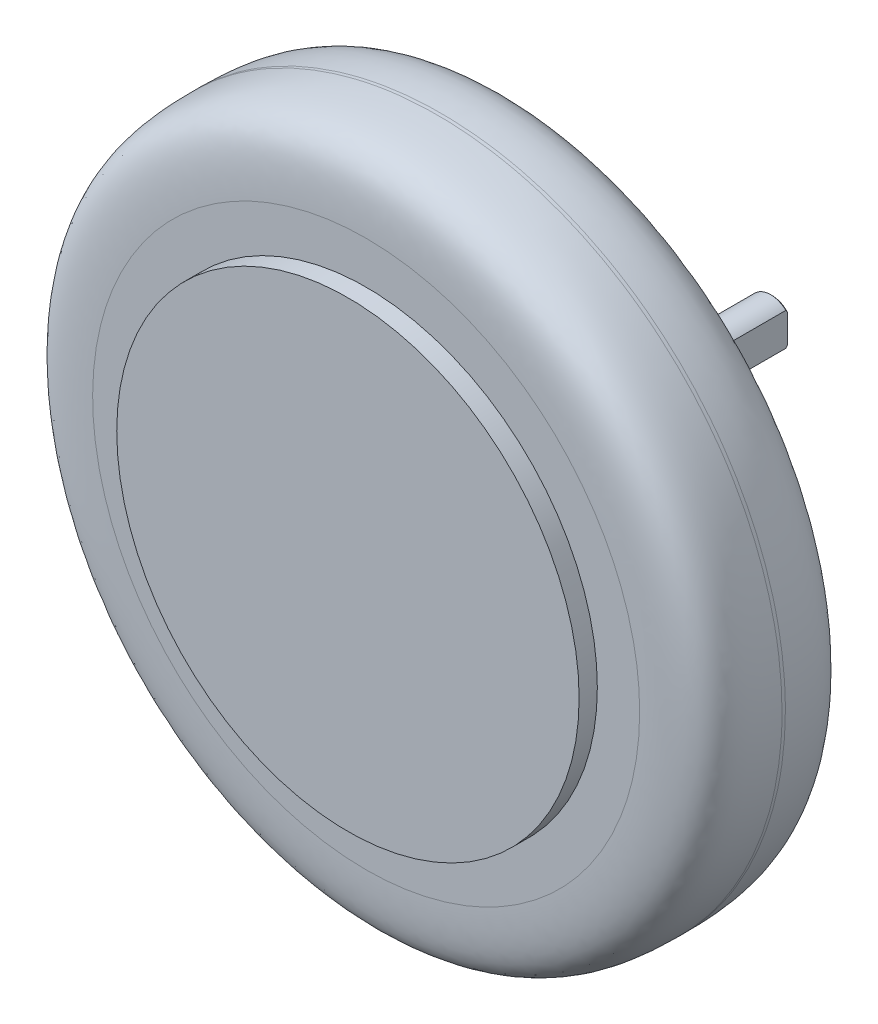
ISO-10303-21;
HEADER;
FILE_DESCRIPTION(('STEP AP214'),'2;1');
FILE_NAME('part.step','',(''),(''),'','','');
FILE_SCHEMA(('AUTOMOTIVE_DESIGN { 1 0 10303 214 1 1 1 1 }'));
ENDSEC;
DATA;
#1=APPLICATION_CONTEXT('core data for automotive mechanical design processes');
#2=APPLICATION_PROTOCOL_DEFINITION('international standard','automotive_design',2000,#1);
#3=PRODUCT_CONTEXT('',#1,'mechanical');
#4=PRODUCT('Part','Part','',(#3));
#5=PRODUCT_RELATED_PRODUCT_CATEGORY('part','',(#4));
#6=PRODUCT_DEFINITION_FORMATION('','',#4);
#7=PRODUCT_DEFINITION_CONTEXT('part definition',#1,'design');
#8=PRODUCT_DEFINITION('design','',#6,#7);
#9=PRODUCT_DEFINITION_SHAPE('','',#8);
#10=(LENGTH_UNIT() NAMED_UNIT(*) SI_UNIT(.MILLI.,.METRE.));
#11=(NAMED_UNIT(*) PLANE_ANGLE_UNIT() SI_UNIT($,.RADIAN.));
#12=(NAMED_UNIT(*) SI_UNIT($,.STERADIAN.) SOLID_ANGLE_UNIT());
#13=UNCERTAINTY_MEASURE_WITH_UNIT(LENGTH_MEASURE(1.E-05),#10,'distance_accuracy_value','');
#14=(GEOMETRIC_REPRESENTATION_CONTEXT(3) GLOBAL_UNCERTAINTY_ASSIGNED_CONTEXT((#13)) GLOBAL_UNIT_ASSIGNED_CONTEXT((#10,
#11,#12)) REPRESENTATION_CONTEXT('',''));
#15=CARTESIAN_POINT('',(0.,0.,0.));
#16=DIRECTION('',(0.,0.,1.));
#17=DIRECTION('',(1.,0.,0.));
#18=AXIS2_PLACEMENT_3D('',#15,#16,#17);
#19=CARTESIAN_POINT('',(0.,0.,49.5));
#20=DIRECTION('',(0.,0.,-1.));
#21=DIRECTION('',(-1.,0.,0.));
#22=AXIS2_PLACEMENT_3D('',#19,#20,#21);
#23=CYLINDRICAL_SURFACE('',#22,8.);
#24=CARTESIAN_POINT('',(0.,0.,49.5));
#25=DIRECTION('',(0.,0.,1.));
#26=DIRECTION('',(1.,0.,0.));
#27=AXIS2_PLACEMENT_3D('',#24,#25,#26);
#28=CIRCLE('',#27,8.);
#29=CARTESIAN_POINT('',(8.,0.,49.5));
#30=VERTEX_POINT('',#29);
#31=EDGE_CURVE('E80',#30,#30,#28,.T.);
#32=ORIENTED_EDGE('',*,*,#31,.F.);
#33=EDGE_LOOP('',(#32));
#34=FACE_BOUND('',#33,.T.);
#35=CARTESIAN_POINT('',(0.,0.,0.507999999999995));
#36=DIRECTION('',(0.,0.,1.));
#37=DIRECTION('',(1.,0.,0.));
#38=AXIS2_PLACEMENT_3D('',#35,#36,#37);
#39=CIRCLE('',#38,8.);
#40=CARTESIAN_POINT('',(5.44,5.86569688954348,0.507999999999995));
#41=VERTEX_POINT('',#40);
#42=CARTESIAN_POINT('',(5.44,-5.86569688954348,0.507999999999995));
#43=VERTEX_POINT('',#42);
#44=EDGE_CURVE('E79',#41,#43,#39,.T.);
#45=ORIENTED_EDGE('',*,*,#44,.T.);
#46=DIRECTION('',(0.,0.,-1.));
#47=VECTOR('',#46,1.);
#48=CARTESIAN_POINT('',(5.44,-5.86569688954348,46.30000008));
#49=LINE('',#48,#47);
#50=CARTESIAN_POINT('',(5.44,-5.86569688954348,46.30000008));
#51=VERTEX_POINT('',#50);
#52=EDGE_CURVE('E81',#51,#43,#49,.T.);
#53=ORIENTED_EDGE('',*,*,#52,.F.);
#54=CARTESIAN_POINT('',(0.,0.,46.30000008));
#55=DIRECTION('',(0.,0.,-1.));
#56=DIRECTION('',(-1.,0.,0.));
#57=AXIS2_PLACEMENT_3D('',#54,#55,#56);
#58=CIRCLE('',#57,8.);
#59=CARTESIAN_POINT('',(5.44,5.86569688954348,46.30000008));
#60=VERTEX_POINT('',#59);
#61=EDGE_CURVE('E64',#60,#51,#58,.T.);
#62=ORIENTED_EDGE('',*,*,#61,.F.);
#63=DIRECTION('',(0.,0.,-1.));
#64=VECTOR('',#63,1.);
#65=CARTESIAN_POINT('',(5.44,5.86569688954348,46.30000008));
#66=LINE('',#65,#64);
#67=EDGE_CURVE('E58',#60,#41,#66,.T.);
#68=ORIENTED_EDGE('',*,*,#67,.T.);
#69=EDGE_LOOP('',(#45,#53,#62,#68));
#70=FACE_BOUND('',#69,.T.);
#71=ADVANCED_FACE('F38',(#34,#70),#23,.T.);
#72=CARTESIAN_POINT('',(0.,0.,0.));
#73=DIRECTION('',(0.,0.,1.));
#74=DIRECTION('',(1.,0.,0.));
#75=AXIS2_PLACEMENT_3D('',#72,#73,#74);
#76=PLANE('',#75);
#77=DIRECTION('',(0.,1.,0.));
#78=VECTOR('',#77,1.);
#79=CARTESIAN_POINT('',(5.44,0.,0.));
#80=LINE('',#79,#78);
#81=CARTESIAN_POINT('',(5.44,-5.15135554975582,0.));
#82=VERTEX_POINT('',#81);
#83=CARTESIAN_POINT('',(5.44,5.15135554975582,0.));
#84=VERTEX_POINT('',#83);
#85=EDGE_CURVE('E87',#82,#84,#80,.T.);
#86=ORIENTED_EDGE('',*,*,#85,.F.);
#87=CARTESIAN_POINT('',(0.,0.,0.));
#88=DIRECTION('',(0.,0.,1.));
#89=DIRECTION('',(1.,0.,0.));
#90=AXIS2_PLACEMENT_3D('',#87,#88,#89);
#91=CIRCLE('',#90,7.49200000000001);
#92=EDGE_CURVE('E96',#82,#84,#91,.F.);
#93=ORIENTED_EDGE('',*,*,#92,.T.);
#94=EDGE_LOOP('',(#86,#93));
#95=FACE_BOUND('',#94,.T.);
#96=ADVANCED_FACE('F261',(#95),#76,.F.);
#97=CARTESIAN_POINT('',(0.,0.,0.507999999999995));
#98=DIRECTION('',(0.,0.,1.));
#99=DIRECTION('',(1.,0.,0.));
#100=AXIS2_PLACEMENT_3D('',#97,#98,#99);
#101=CONICAL_SURFACE('',#100,8.,0.785398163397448);
#102=ORIENTED_EDGE('',*,*,#44,.F.);
#103=CARTESIAN_POINT('',(5.44,12.9113293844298,6.51856838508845));
#104=CARTESIAN_POINT('',(5.44,12.7193784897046,6.34168075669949));
#105=CARTESIAN_POINT('',(5.44,12.5271347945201,6.16511092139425));
#106=CARTESIAN_POINT('',(5.44,12.141975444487,5.81270281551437));
#107=CARTESIAN_POINT('',(5.44,11.9490597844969,5.63686455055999));
#108=CARTESIAN_POINT('',(5.44,11.3690945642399,5.11051784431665));
#109=CARTESIAN_POINT('',(5.44,10.9809112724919,4.76125552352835));
#110=CARTESIAN_POINT('',(5.44,10.1982450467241,4.06505864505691));
#111=CARTESIAN_POINT('',(5.44,9.80373822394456,3.71815089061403));
#112=CARTESIAN_POINT('',(5.44,9.00942420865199,3.03053142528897));
#113=CARTESIAN_POINT('',(5.44,8.60961765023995,2.68981898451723));
#114=CARTESIAN_POINT('',(5.44,7.87850965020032,2.08044621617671));
#115=CARTESIAN_POINT('',(5.44,7.5484647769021,1.8102854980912));
#116=CARTESIAN_POINT('',(5.44,7.04849728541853,1.41108454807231));
#117=CARTESIAN_POINT('',(5.44,6.88100086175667,1.27900610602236));
#118=CARTESIAN_POINT('',(5.44,6.54412135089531,1.01728053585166));
#119=CARTESIAN_POINT('',(5.44,6.37473830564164,0.887633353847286));
#120=CARTESIAN_POINT('',(5.44,6.03394819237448,0.631393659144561));
#121=CARTESIAN_POINT('',(5.44,5.86254340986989,0.504798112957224));
#122=CARTESIAN_POINT('',(5.44,5.51717011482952,0.255161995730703));
#123=CARTESIAN_POINT('',(5.44,5.34320172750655,0.132121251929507));
#124=CARTESIAN_POINT('',(5.44,4.99231442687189,-0.109546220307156));
#125=CARTESIAN_POINT('',(5.44,4.81539667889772,-0.228174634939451));
#126=CARTESIAN_POINT('',(5.44,4.45804089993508,-0.45998525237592));
#127=CARTESIAN_POINT('',(5.44,4.27760327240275,-0.573168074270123));
#128=CARTESIAN_POINT('',(5.44,3.91432052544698,-0.791653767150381));
#129=CARTESIAN_POINT('',(5.44,3.73151442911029,-0.897021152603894));
#130=CARTESIAN_POINT('',(5.44,3.36119601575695,-1.09925612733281));
#131=CARTESIAN_POINT('',(5.44,3.17368318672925,-1.19612278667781));
#132=CARTESIAN_POINT('',(5.44,2.79355877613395,-1.37891365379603));
#133=CARTESIAN_POINT('',(5.44,2.60095198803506,-1.46484773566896));
#134=CARTESIAN_POINT('',(5.44,2.21012000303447,-1.62290017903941));
#135=CARTESIAN_POINT('',(5.44,2.01189645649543,-1.69502255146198));
#136=CARTESIAN_POINT('',(5.44,1.65325108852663,-1.8082975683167));
#137=CARTESIAN_POINT('',(5.44,1.49388530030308,-1.85277481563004));
#138=CARTESIAN_POINT('',(5.44,1.17218190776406,-1.92933631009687));
#139=CARTESIAN_POINT('',(5.44,1.00984469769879,-1.96142218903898));
#140=CARTESIAN_POINT('',(5.44,0.683488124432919,-2.01159349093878));
#141=CARTESIAN_POINT('',(5.44,0.519475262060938,-2.02972059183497));
#142=CARTESIAN_POINT('',(5.44,0.190474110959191,-2.05114095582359));
#143=CARTESIAN_POINT('',(5.44,0.0254858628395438,-2.05443483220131));
#144=CARTESIAN_POINT('',(5.44,-0.304337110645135,-2.04599231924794));
#145=CARTESIAN_POINT('',(5.44,-0.469171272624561,-2.03423427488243));
#146=CARTESIAN_POINT('',(5.44,-0.797161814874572,-1.99631880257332));
#147=CARTESIAN_POINT('',(5.44,-0.960318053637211,-1.97016017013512));
#148=CARTESIAN_POINT('',(5.44,-1.28444926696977,-1.90468234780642));
#149=CARTESIAN_POINT('',(5.44,-1.44541606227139,-1.86532322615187));
#150=CARTESIAN_POINT('',(5.44,-1.76407417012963,-1.77516640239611));
#151=CARTESIAN_POINT('',(5.44,-1.92176541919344,-1.72436847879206));
#152=CARTESIAN_POINT('',(5.44,-2.25967748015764,-1.60380598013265));
#153=CARTESIAN_POINT('',(5.44,-2.43926934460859,-1.53229110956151));
#154=CARTESIAN_POINT('',(5.44,-2.79386715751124,-1.37859340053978));
#155=CARTESIAN_POINT('',(5.44,-2.96887098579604,-1.29640573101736));
#156=CARTESIAN_POINT('',(5.44,-3.31488974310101,-1.12335737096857));
#157=CARTESIAN_POINT('',(5.44,-3.48589709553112,-1.03248164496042));
#158=CARTESIAN_POINT('',(5.44,-3.82404685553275,-0.843899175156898));
#159=CARTESIAN_POINT('',(5.44,-3.99118979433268,-0.746193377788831));
#160=CARTESIAN_POINT('',(5.44,-4.32411119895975,-0.544062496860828));
#161=CARTESIAN_POINT('',(5.44,-4.48984890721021,-0.439570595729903));
#162=CARTESIAN_POINT('',(5.44,-4.81834787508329,-0.226017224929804));
#163=CARTESIAN_POINT('',(5.44,-4.98110906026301,-0.116955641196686));
#164=CARTESIAN_POINT('',(5.44,-5.30389110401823,0.104783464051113));
#165=CARTESIAN_POINT('',(5.44,-5.46391465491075,0.217457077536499));
#166=CARTESIAN_POINT('',(5.44,-5.78174993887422,0.445886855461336));
#167=CARTESIAN_POINT('',(5.44,-5.9395615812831,0.561643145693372));
#168=CARTESIAN_POINT('',(5.44,-6.40373184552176,0.907961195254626));
#169=CARTESIAN_POINT('',(5.44,-6.70738710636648,1.14214616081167));
#170=CARTESIAN_POINT('',(5.44,-7.30916105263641,1.61752939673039));
#171=CARTESIAN_POINT('',(5.44,-7.60727923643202,1.85872829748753));
#172=CARTESIAN_POINT('',(5.44,-8.1994398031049,2.34650740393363));
#173=CARTESIAN_POINT('',(5.44,-8.49347901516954,2.59309145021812));
#174=CARTESIAN_POINT('',(5.44,-9.07818796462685,3.09022285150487));
#175=CARTESIAN_POINT('',(5.44,-9.36885764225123,3.34077027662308));
#176=CARTESIAN_POINT('',(5.44,-9.93329874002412,3.83256688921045));
#177=CARTESIAN_POINT('',(5.44,-10.2071990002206,4.07366844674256));
#178=CARTESIAN_POINT('',(5.44,-10.7530165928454,4.55811097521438));
#179=CARTESIAN_POINT('',(5.44,-11.0249338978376,4.8014519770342));
#180=CARTESIAN_POINT('',(5.44,-11.5667139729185,5.28957451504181));
#181=CARTESIAN_POINT('',(5.44,-11.8365792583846,5.53435326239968));
#182=CARTESIAN_POINT('',(5.44,-12.3749255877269,6.02540997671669));
#183=CARTESIAN_POINT('',(5.44,-12.6434066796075,6.27168789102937));
#184=CARTESIAN_POINT('',(5.44,-12.9113293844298,6.51856838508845));
#185=B_SPLINE_CURVE_WITH_KNOTS('',3,(#103,#104,#105,#106,#107,#108,#109,#110,#111,#112,#113,
#114,#115,#116,#117,#118,#119,#120,#121,#122,#123,#124,#125,#126,#127,#128,#129,#130,#131,#132,
#133,#134,#135,#136,#137,#138,#139,#140,#141,#142,#143,#144,#145,#146,#147,#148,#149,#150,#151,
#152,#153,#154,#155,#156,#157,#158,#159,#160,#161,#162,#163,#164,#165,#166,#167,#168,#169,#170,
#171,#172,#173,#174,#175,#176,#177,#178,#179,#180,#181,#182,#183,#184),.UNSPECIFIED.,.F.,.F.,(4,
2,2,2,2,2,2,2,2,2,2,2,2,2,2,2,2,2,2,2,2,2,2,2,2,2,2,2,2,2,2,2,2,2,2,2,2,2,2,2,4),(0.,
0.783076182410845,1.56615836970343,3.13266780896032,4.70863942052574,6.28442414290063,
7.5638695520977,8.20377223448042,8.84366071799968,9.48288443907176,10.1220770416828,
10.7610228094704,11.3998957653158,12.0327139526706,12.6656012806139,13.2979128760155,
13.9300405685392,14.4259878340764,14.9218697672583,15.4162652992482,15.9106403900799,
16.4057275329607,16.9008560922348,17.397496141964,17.8941458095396,18.4736292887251,
19.0533759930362,19.6341448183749,20.2148333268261,20.8025240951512,21.390229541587,
21.9773192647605,22.5644329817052,23.7146784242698,24.865027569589,26.0162258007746,
27.167444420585,28.2621268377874,29.3568243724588,30.4498394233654,31.5428163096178),.UNSPECIFIED.);
#186=EDGE_CURVE('E84',#41,#84,#185,.T.);
#187=ORIENTED_EDGE('',*,*,#186,.T.);
#188=ORIENTED_EDGE('',*,*,#92,.F.);
#189=EDGE_CURVE('E93',#82,#43,#185,.T.);
#190=ORIENTED_EDGE('',*,*,#189,.T.);
#191=EDGE_LOOP('',(#102,#187,#188,#190));
#192=FACE_BOUND('',#191,.T.);
#193=ADVANCED_FACE('F95',(#192),#101,.T.);
#194=CARTESIAN_POINT('',(0.,0.,144.84));
#195=DIRECTION('',(0.,0.,1.));
#196=DIRECTION('',(1.,0.,0.));
#197=AXIS2_PLACEMENT_3D('',#194,#195,#196);
#198=PLANE('',#197);
#199=CARTESIAN_POINT('',(97.6,0.,144.84));
#200=CARTESIAN_POINT('',(97.6000025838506,-1.59694091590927,144.84));
#201=CARTESIAN_POINT('',(97.5603102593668,-3.19384989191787,144.84));
#202=CARTESIAN_POINT('',(97.4022888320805,-6.38375110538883,144.84));
#203=CARTESIAN_POINT('',(97.28396100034,-7.97674340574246,144.84));
#204=CARTESIAN_POINT('',(96.9694187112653,-11.1550389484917,144.84));
#205=CARTESIAN_POINT('',(96.7732028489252,-12.7403420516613,144.84));
#206=CARTESIAN_POINT('',(96.3036341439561,-15.8995092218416,144.84));
#207=CARTESIAN_POINT('',(96.0302799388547,-17.4733730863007,144.84));
#208=CARTESIAN_POINT('',(95.4071805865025,-20.6059053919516,144.84));
#209=CARTESIAN_POINT('',(95.0574354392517,-22.1645738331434,144.84));
#210=CARTESIAN_POINT('',(94.2822990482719,-25.2629604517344,144.84));
#211=CARTESIAN_POINT('',(93.8569091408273,-26.8026789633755,144.84));
#212=CARTESIAN_POINT('',(92.9312286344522,-29.8594089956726,144.84));
#213=CARTESIAN_POINT('',(92.430939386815,-31.3764209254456,144.84));
#214=CARTESIAN_POINT('',(91.3562047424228,-34.383986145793,144.84));
#215=CARTESIAN_POINT('',(90.7817581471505,-35.8745390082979,144.84));
#216=CARTESIAN_POINT('',(89.559526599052,-38.8252669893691,144.84));
#217=CARTESIAN_POINT('',(88.9117416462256,-40.2854421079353,144.84));
#218=CARTESIAN_POINT('',(87.5450240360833,-43.1720640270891,144.84));
#219=CARTESIAN_POINT('',(86.8260925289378,-44.5985113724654,144.84));
#220=CARTESIAN_POINT('',(85.3192129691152,-47.4145008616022,144.84));
#221=CARTESIAN_POINT('',(84.5312636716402,-48.8040423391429,144.84));
#222=CARTESIAN_POINT('',(82.8884776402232,-51.5430367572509,144.84));
#223=CARTESIAN_POINT('',(82.0336397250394,-52.8924889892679,144.84));
#224=CARTESIAN_POINT('',(80.2592028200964,-55.5481214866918,144.84));
#225=CARTESIAN_POINT('',(79.3396038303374,-56.8543017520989,144.84));
#226=CARTESIAN_POINT('',(77.4377699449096,-59.4202059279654,144.84));
#227=CARTESIAN_POINT('',(76.4555361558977,-60.6799306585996,144.84));
#228=CARTESIAN_POINT('',(74.4305589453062,-63.1497383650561,144.84));
#229=CARTESIAN_POINT('',(73.387816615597,-64.3598222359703,144.84));
#230=CARTESIAN_POINT('',(71.2439458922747,-66.7271670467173,144.84));
#231=CARTESIAN_POINT('',(70.1428165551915,-67.8844271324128,144.84));
#232=CARTESIAN_POINT('',(67.8844271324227,-70.1428165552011,144.84));
#233=CARTESIAN_POINT('',(66.7271670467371,-71.2439458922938,144.84));
#234=CARTESIAN_POINT('',(64.3598222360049,-73.3878166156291,144.84));
#235=CARTESIAN_POINT('',(63.1497383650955,-74.4305589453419,144.84));
#236=CARTESIAN_POINT('',(60.6799306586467,-76.4555361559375,144.84));
#237=CARTESIAN_POINT('',(59.4202059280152,-77.4377699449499,144.84));
#238=CARTESIAN_POINT('',(56.8543017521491,-79.3396038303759,144.84));
#239=CARTESIAN_POINT('',(55.5481214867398,-80.2592028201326,144.84));
#240=CARTESIAN_POINT('',(52.892488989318,-82.0336397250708,144.84));
#241=CARTESIAN_POINT('',(51.5430367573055,-82.8884776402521,144.84));
#242=CARTESIAN_POINT('',(48.8040423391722,-84.5312636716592,144.84));
#243=CARTESIAN_POINT('',(47.4145008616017,-85.3192129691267,144.84));
#244=CARTESIAN_POINT('',(44.5985113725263,-86.8260925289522,144.84));
#245=CARTESIAN_POINT('',(43.1720640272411,-87.545024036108,144.84));
#246=CARTESIAN_POINT('',(40.2854421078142,-88.9117416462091,144.84));
#247=CARTESIAN_POINT('',(38.8252669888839,-89.5595265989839,144.84));
#248=CARTESIAN_POINT('',(35.8745390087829,-90.7817581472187,144.84));
#249=CARTESIAN_POINT('',(34.3839861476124,-91.3562047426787,144.84));
#250=CARTESIAN_POINT('',(31.3764209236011,-92.4309393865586,144.84));
#251=CARTESIAN_POINT('',(29.8594089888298,-92.9312286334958,144.84));
#252=CARTESIAN_POINT('',(26.802678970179,-93.8569091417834,144.84));
#253=CARTESIAN_POINT('',(25.262960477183,-94.2822990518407,144.84));
#254=CARTESIAN_POINT('',(22.1645738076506,-95.0574354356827,144.84));
#255=CARTESIAN_POINT('',(20.6059052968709,-95.4071805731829,144.84));
#256=CARTESIAN_POINT('',(17.4733731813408,-96.0302799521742,144.84));
#257=CARTESIAN_POINT('',(15.8995095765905,-96.3036341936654,144.84));
#258=CARTESIAN_POINT('',(12.7403416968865,-96.7732027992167,144.84));
#259=CARTESIAN_POINT('',(11.1550376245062,-96.9694185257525,144.84));
#260=CARTESIAN_POINT('',(7.9767447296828,-97.2839611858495,144.84));
#261=CARTESIAN_POINT('',(6.38375604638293,-97.4022895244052,144.84));
#262=CARTESIAN_POINT('',(3.19384495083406,-97.5603095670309,144.84));
#263=CARTESIAN_POINT('',(1.59692247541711,-97.6000000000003,144.84));
#264=CARTESIAN_POINT('',(-1.59692247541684,-97.5999999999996,144.84));
#265=CARTESIAN_POINT('',(-3.19384495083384,-97.5603095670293,144.84));
#266=CARTESIAN_POINT('',(-6.38375604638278,-97.4022895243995,144.84));
#267=CARTESIAN_POINT('',(-7.97674472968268,-97.2839611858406,144.84));
#268=CARTESIAN_POINT('',(-11.1550376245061,-96.9694185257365,144.84));
#269=CARTESIAN_POINT('',(-12.7403416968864,-96.773202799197,144.84));
#270=CARTESIAN_POINT('',(-15.8995095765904,-96.3036341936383,144.84));
#271=CARTESIAN_POINT('',(-17.4733731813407,-96.0302799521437,144.84));
#272=CARTESIAN_POINT('',(-20.6059052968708,-95.4071805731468,144.84));
#273=CARTESIAN_POINT('',(-22.1645738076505,-95.0574354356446,144.84));
#274=CARTESIAN_POINT('',(-25.2629604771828,-94.2822990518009,144.84));
#275=CARTESIAN_POINT('',(-26.8026789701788,-93.8569091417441,144.84));
#276=CARTESIAN_POINT('',(-29.8594089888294,-92.9312286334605,144.84));
#277=CARTESIAN_POINT('',(-31.3764209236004,-92.4309393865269,144.84));
#278=CARTESIAN_POINT('',(-34.3839861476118,-91.35620474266,144.84));
#279=CARTESIAN_POINT('',(-35.8745390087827,-90.7817581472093,144.84));
#280=CARTESIAN_POINT('',(-38.8252669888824,-89.5595265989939,144.84));
#281=CARTESIAN_POINT('',(-40.2854421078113,-88.9117416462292,144.84));
#282=CARTESIAN_POINT('',(-43.1720640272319,-87.5450240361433,144.84));
#283=CARTESIAN_POINT('',(-44.5985113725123,-86.8260925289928,144.84));
#284=CARTESIAN_POINT('',(-47.4145008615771,-85.319212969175,144.84));
#285=CARTESIAN_POINT('',(-48.8040423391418,-84.5312636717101,144.84));
#286=CARTESIAN_POINT('',(-51.543036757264,-82.8884776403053,144.84));
#287=CARTESIAN_POINT('',(-52.8924889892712,-82.0336397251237,144.84));
#288=CARTESIAN_POINT('',(-55.5481214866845,-80.259202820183,144.84));
#289=CARTESIAN_POINT('',(-56.8543017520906,-79.3396038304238,144.84));
#290=CARTESIAN_POINT('',(-59.4202059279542,-77.4377699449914,144.84));
#291=CARTESIAN_POINT('',(-60.6799306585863,-76.4555361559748,144.84));
#292=CARTESIAN_POINT('',(-63.1497383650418,-74.4305589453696,144.84));
#293=CARTESIAN_POINT('',(-64.359822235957,-73.3878166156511,144.84));
#294=CARTESIAN_POINT('',(-66.7271670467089,-71.2439458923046,144.84));
#295=CARTESIAN_POINT('',(-67.8844271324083,-70.1428165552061,144.84));
#296=CARTESIAN_POINT('',(-70.1428165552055,-67.8844271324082,144.84));
#297=CARTESIAN_POINT('',(-71.2439458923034,-66.7271670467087,144.84));
#298=CARTESIAN_POINT('',(-73.3878166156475,-64.3598222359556,144.84));
#299=CARTESIAN_POINT('',(-74.430558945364,-63.1497383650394,144.84));
#300=CARTESIAN_POINT('',(-76.4555361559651,-60.679930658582,144.84));
#301=CARTESIAN_POINT('',(-77.4377699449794,-59.4202059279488,144.84));
#302=CARTESIAN_POINT('',(-79.3396038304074,-56.8543017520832,144.84));
#303=CARTESIAN_POINT('',(-80.2592028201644,-55.5481214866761,144.84));
#304=CARTESIAN_POINT('',(-82.0336397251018,-52.8924889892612,144.84));
#305=CARTESIAN_POINT('',(-82.8884776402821,-51.5430367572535,144.84));
#306=CARTESIAN_POINT('',(-84.5312636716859,-48.8040423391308,144.84));
#307=CARTESIAN_POINT('',(-85.3192129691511,-47.4145008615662,144.84));
#308=CARTESIAN_POINT('',(-86.8260925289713,-44.5985113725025,144.84));
#309=CARTESIAN_POINT('',(-87.5450240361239,-43.172064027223,144.84));
#310=CARTESIAN_POINT('',(-88.9117416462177,-40.285442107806,144.84));
#311=CARTESIAN_POINT('',(-89.5595265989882,-38.8252669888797,144.84));
#312=CARTESIAN_POINT('',(-90.7817581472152,-35.8745390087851,144.84));
#313=CARTESIAN_POINT('',(-91.3562047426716,-34.3839861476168,144.84));
#314=CARTESIAN_POINT('',(-92.4309393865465,-31.3764209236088,144.84));
#315=CARTESIAN_POINT('',(-92.9312286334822,-29.8594089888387,144.84));
#316=CARTESIAN_POINT('',(-93.8569091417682,-26.8026789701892,144.84));
#317=CARTESIAN_POINT('',(-94.2822990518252,-25.2629604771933,144.84));
#318=CARTESIAN_POINT('',(-95.0574354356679,-22.1645738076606,144.84));
#319=CARTESIAN_POINT('',(-95.4071805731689,-20.6059052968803,144.84));
#320=CARTESIAN_POINT('',(-96.0302799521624,-17.4733731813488,144.84));
#321=CARTESIAN_POINT('',(-96.3036341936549,-15.8995095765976,144.84));
#322=CARTESIAN_POINT('',(-96.773202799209,-12.7403416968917,144.84));
#323=CARTESIAN_POINT('',(-96.9694185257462,-11.1550376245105,144.84));
#324=CARTESIAN_POINT('',(-97.2839611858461,-7.97674472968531,144.84));
#325=CARTESIAN_POINT('',(-97.4022895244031,-6.38375604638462,144.84));
#326=CARTESIAN_POINT('',(-97.5603095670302,-3.19384495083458,144.84));
#327=CARTESIAN_POINT('',(-97.5999999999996,-1.59692247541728,144.84));
#328=CARTESIAN_POINT('',(-97.6000000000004,1.59692247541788,144.84));
#329=CARTESIAN_POINT('',(-97.5603095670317,3.19384495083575,144.84));
#330=CARTESIAN_POINT('',(-97.4022895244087,6.38375604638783,144.84));
#331=CARTESIAN_POINT('',(-97.283961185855,7.97674472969,144.84));
#332=CARTESIAN_POINT('',(-96.9694185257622,11.1550376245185,144.84));
#333=CARTESIAN_POINT('',(-96.7732027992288,12.7403416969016,144.84));
#334=CARTESIAN_POINT('',(-96.3036341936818,15.899509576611,144.84));
#335=CARTESIAN_POINT('',(-96.0302799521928,17.473373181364,144.84));
#336=CARTESIAN_POINT('',(-95.4071805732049,20.6059052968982,144.84));
#337=CARTESIAN_POINT('',(-95.0574354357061,22.1645738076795,144.84));
#338=CARTESIAN_POINT('',(-94.282299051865,25.2629604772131,144.84));
#339=CARTESIAN_POINT('',(-93.8569091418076,26.8026789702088,144.84));
#340=CARTESIAN_POINT('',(-92.9312286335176,29.8594089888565,144.84));
#341=CARTESIAN_POINT('',(-92.4309393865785,31.3764209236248,144.84));
#342=CARTESIAN_POINT('',(-91.3562047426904,34.3839861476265,144.84));
#343=CARTESIAN_POINT('',(-90.7817581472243,35.8745390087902,144.84));
#344=CARTESIAN_POINT('',(-89.5595265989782,38.8252669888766,144.84));
#345=CARTESIAN_POINT('',(-88.9117416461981,40.2854421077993,144.84));
#346=CARTESIAN_POINT('',(-87.5450240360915,43.1720640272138,144.84));
#347=CARTESIAN_POINT('',(-86.8260925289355,44.5985113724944,144.84));
#348=CARTESIAN_POINT('',(-85.3192129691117,47.4145008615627,144.84));
#349=CARTESIAN_POINT('',(-84.5312636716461,48.8040423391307,144.84));
#350=CARTESIAN_POINT('',(-82.8884776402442,51.5430367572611,144.84));
#351=CARTESIAN_POINT('',(-82.0336397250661,52.8924889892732,144.84));
#352=CARTESIAN_POINT('',(-80.2592028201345,55.5481214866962,144.84));
#353=CARTESIAN_POINT('',(-79.339603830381,56.8543017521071,144.84));
#354=CARTESIAN_POINT('',(-77.4377699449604,59.4202059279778,144.84));
#355=CARTESIAN_POINT('',(-76.4555361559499,60.6799306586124,144.84));
#356=CARTESIAN_POINT('',(-74.430558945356,63.1497383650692,144.84));
#357=CARTESIAN_POINT('',(-73.3878166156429,64.3598222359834,144.84));
#358=CARTESIAN_POINT('',(-71.2439458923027,66.727167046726,144.84));
#359=CARTESIAN_POINT('',(-70.1428165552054,67.8844271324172,144.84));
#360=CARTESIAN_POINT('',(-67.8844271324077,70.1428165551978,144.84));
#361=CARTESIAN_POINT('',(-66.7271670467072,71.2439458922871,144.84));
#362=CARTESIAN_POINT('',(-64.3598222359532,73.3878166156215,144.84));
#363=CARTESIAN_POINT('',(-63.1497383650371,74.4305589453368,144.84));
#364=CARTESIAN_POINT('',(-60.6799306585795,76.4555361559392,144.84));
#365=CARTESIAN_POINT('',(-59.420205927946,77.4377699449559,144.84));
#366=CARTESIAN_POINT('',(-56.8543017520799,79.3396038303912,144.84));
#367=CARTESIAN_POINT('',(-55.5481214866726,80.259202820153,144.84));
#368=CARTESIAN_POINT('',(-52.8924889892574,82.0336397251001,144.84));
#369=CARTESIAN_POINT('',(-51.5430367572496,82.8884776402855,144.84));
#370=CARTESIAN_POINT('',(-48.8040423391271,84.5312636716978,144.84));
#371=CARTESIAN_POINT('',(-47.4145008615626,85.3192129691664,144.84));
#372=CARTESIAN_POINT('',(-44.5985113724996,86.8260925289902,144.84));
#373=CARTESIAN_POINT('',(-43.1720640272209,87.5450240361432,144.84));
#374=CARTESIAN_POINT('',(-40.2854421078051,88.9117416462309,144.84));
#375=CARTESIAN_POINT('',(-38.8252669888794,89.5595265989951,144.84));
#376=CARTESIAN_POINT('',(-35.874539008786,90.781758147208,144.84));
#377=CARTESIAN_POINT('',(-34.3839861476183,91.3562047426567,144.84));
#378=CARTESIAN_POINT('',(-31.3764209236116,92.430939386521,144.84));
#379=CARTESIAN_POINT('',(-29.8594089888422,92.9312286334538,144.84));
#380=CARTESIAN_POINT('',(-26.8026789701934,93.8569091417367,144.84));
#381=CARTESIAN_POINT('',(-25.2629604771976,94.2822990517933,144.84));
#382=CARTESIAN_POINT('',(-22.1645738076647,95.0574354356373,144.84));
#383=CARTESIAN_POINT('',(-20.6059052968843,95.4071805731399,144.84));
#384=CARTESIAN_POINT('',(-17.4733731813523,96.0302799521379,144.84));
#385=CARTESIAN_POINT('',(-15.8995095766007,96.3036341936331,144.84));
#386=CARTESIAN_POINT('',(-12.7403416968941,96.7732027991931,144.84));
#387=CARTESIAN_POINT('',(-11.1550376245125,96.9694185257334,144.84));
#388=CARTESIAN_POINT('',(-7.97674472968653,97.2839611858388,144.84));
#389=CARTESIAN_POINT('',(-6.3837560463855,97.4022895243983,144.84));
#390=CARTESIAN_POINT('',(-3.19384495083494,97.560309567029,144.84));
#391=CARTESIAN_POINT('',(-1.59692247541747,97.5999999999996,144.84));
#392=CARTESIAN_POINT('',(1.59692247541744,97.6000000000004,144.84));
#393=CARTESIAN_POINT('',(3.19384495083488,97.5603095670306,144.84));
#394=CARTESIAN_POINT('',(6.38375604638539,97.402289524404,144.84));
#395=CARTESIAN_POINT('',(7.97674472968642,97.2839611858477,144.84));
#396=CARTESIAN_POINT('',(11.1550376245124,96.9694185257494,144.84));
#397=CARTESIAN_POINT('',(12.740341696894,96.7732027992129,144.84));
#398=CARTESIAN_POINT('',(15.8995095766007,96.3036341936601,144.84));
#399=CARTESIAN_POINT('',(17.4733731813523,96.0302799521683,144.84));
#400=CARTESIAN_POINT('',(20.6059052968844,95.4071805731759,144.84));
#401=CARTESIAN_POINT('',(22.1645738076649,95.0574354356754,144.84));
#402=CARTESIAN_POINT('',(25.2629604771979,94.282299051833,144.84));
#403=CARTESIAN_POINT('',(26.8026789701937,93.8569091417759,144.84));
#404=CARTESIAN_POINT('',(29.8594089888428,92.9312286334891,144.84));
#405=CARTESIAN_POINT('',(31.3764209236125,92.4309393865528,144.84));
#406=CARTESIAN_POINT('',(34.383986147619,91.3562047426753,144.84));
#407=CARTESIAN_POINT('',(35.8745390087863,90.7817581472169,144.84));
#408=CARTESIAN_POINT('',(38.8252669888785,89.5595265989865,144.84));
#409=CARTESIAN_POINT('',(40.2854421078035,88.9117416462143,144.84));
#410=CARTESIAN_POINT('',(43.1720640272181,87.5450240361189,144.84));
#411=CARTESIAN_POINT('',(44.5985113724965,86.8260925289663,144.84));
#412=CARTESIAN_POINT('',(47.4145008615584,85.3192129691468,144.84));
#413=CARTESIAN_POINT('',(48.8040423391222,84.5312636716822,144.84));
#414=CARTESIAN_POINT('',(51.5430367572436,82.8884776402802,144.84));
#415=CARTESIAN_POINT('',(52.8924889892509,82.033639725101,144.84));
#416=CARTESIAN_POINT('',(55.5481214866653,80.2592028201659,144.84));
#417=CARTESIAN_POINT('',(56.8543017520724,79.3396038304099,144.84));
#418=CARTESIAN_POINT('',(59.4202059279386,77.4377699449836,144.84));
#419=CARTESIAN_POINT('',(60.6799306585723,76.45553615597,144.84));
#420=CARTESIAN_POINT('',(63.1497383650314,74.4305589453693,144.84));
#421=CARTESIAN_POINT('',(64.3598222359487,73.3878166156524,144.84));
#422=CARTESIAN_POINT('',(66.7271670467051,71.2439458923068,144.84));
#423=CARTESIAN_POINT('',(67.8844271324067,70.1428165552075,144.84));
#424=CARTESIAN_POINT('',(70.1428165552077,67.8844271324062,144.84));
#425=CARTESIAN_POINT('',(71.243945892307,66.727167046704,144.84));
#426=CARTESIAN_POINT('',(73.3878166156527,64.3598222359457,144.84));
#427=CARTESIAN_POINT('',(74.4305589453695,63.1497383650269,144.84));
#428=CARTESIAN_POINT('',(76.45553615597,60.679930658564,144.84));
#429=CARTESIAN_POINT('',(77.4377699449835,59.420205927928,144.84));
#430=CARTESIAN_POINT('',(79.3396038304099,56.8543017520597,144.84));
#431=CARTESIAN_POINT('',(80.2592028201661,55.5481214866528,144.84));
#432=CARTESIAN_POINT('',(82.0336397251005,52.8924889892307,144.84));
#433=CARTESIAN_POINT('',(82.8884776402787,51.5430367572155,144.84));
#434=CARTESIAN_POINT('',(84.5312636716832,48.8040423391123,144.84));
#435=CARTESIAN_POINT('',(85.3192129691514,47.4145008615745,144.84));
#436=CARTESIAN_POINT('',(86.8260925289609,44.5985113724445,144.84));
#437=CARTESIAN_POINT('',(87.5450240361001,43.1720640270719,144.84));
#438=CARTESIAN_POINT('',(88.9117416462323,40.2854421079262,144.84));
#439=CARTESIAN_POINT('',(89.5595265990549,38.8252669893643,144.84));
#440=CARTESIAN_POINT('',(90.7817581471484,35.8745390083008,144.84));
#441=CARTESIAN_POINT('',(91.3562047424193,34.3839861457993,144.84));
#442=CARTESIAN_POINT('',(92.4309393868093,31.3764209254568,144.84));
#443=CARTESIAN_POINT('',(92.9312286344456,29.8594089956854,144.84));
#444=CARTESIAN_POINT('',(93.8569091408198,26.80267896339,144.84));
#445=CARTESIAN_POINT('',(94.2822990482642,25.2629604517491,144.84));
#446=CARTESIAN_POINT('',(95.0574354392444,22.1645738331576,144.84));
#447=CARTESIAN_POINT('',(95.4071805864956,20.605905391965,144.84));
#448=CARTESIAN_POINT('',(96.0302799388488,17.4733730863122,144.84));
#449=CARTESIAN_POINT('',(96.3036341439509,15.8995092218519,144.84));
#450=CARTESIAN_POINT('',(96.7732028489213,12.7403420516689,144.84));
#451=CARTESIAN_POINT('',(96.9694187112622,11.1550389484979,144.84));
#452=CARTESIAN_POINT('',(97.2839610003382,7.97674340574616,144.84));
#453=CARTESIAN_POINT('',(97.4022888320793,6.38375110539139,144.84));
#454=CARTESIAN_POINT('',(97.5603102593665,3.19384989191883,144.84));
#455=CARTESIAN_POINT('',(97.6000025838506,1.59694091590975,144.84));
#456=CARTESIAN_POINT('',(97.6,0.,144.84));
#457=B_SPLINE_CURVE_WITH_KNOTS('',3,(#199,#200,#201,#202,#203,#204,#205,#206,#207,#208,#209,
#210,#211,#212,#213,#214,#215,#216,#217,#218,#219,#220,#221,#222,#223,#224,#225,#226,#227,#228,
#229,#230,#231,#232,#233,#234,#235,#236,#237,#238,#239,#240,#241,#242,#243,#244,#245,#246,#247,
#248,#249,#250,#251,#252,#253,#254,#255,#256,#257,#258,#259,#260,#261,#262,#263,#264,#265,#266,
#267,#268,#269,#270,#271,#272,#273,#274,#275,#276,#277,#278,#279,#280,#281,#282,#283,#284,#285,
#286,#287,#288,#289,#290,#291,#292,#293,#294,#295,#296,#297,#298,#299,#300,#301,#302,#303,#304,
#305,#306,#307,#308,#309,#310,#311,#312,#313,#314,#315,#316,#317,#318,#319,#320,#321,#322,#323,
#324,#325,#326,#327,#328,#329,#330,#331,#332,#333,#334,#335,#336,#337,#338,#339,#340,#341,#342,
#343,#344,#345,#346,#347,#348,#349,#350,#351,#352,#353,#354,#355,#356,#357,#358,#359,#360,#361,
#362,#363,#364,#365,#366,#367,#368,#369,#370,#371,#372,#373,#374,#375,#376,#377,#378,#379,#380,
#381,#382,#383,#384,#385,#386,#387,#388,#389,#390,#391,#392,#393,#394,#395,#396,#397,#398,#399,
#400,#401,#402,#403,#404,#405,#406,#407,#408,#409,#410,#411,#412,#413,#414,#415,#416,#417,#418,
#419,#420,#421,#422,#423,#424,#425,#426,#427,#428,#429,#430,#431,#432,#433,#434,#435,#436,#437,
#438,#439,#440,#441,#442,#443,#444,#445,#446,#447,#448,#449,#450,#451,#452,#453,#454,#455,#456),
.UNSPECIFIED.,.F.,.F.,(4,2,2,2,2,2,2,2,2,2,2,2,2,2,2,2,2,2,2,2,2,2,2,2,2,2,2,2,2,2,2,2,2,2,2,2,
2,2,2,2,2,2,2,2,2,2,2,2,2,2,2,2,2,2,2,2,2,2,2,2,2,2,2,2,2,2,2,2,2,2,2,2,2,2,2,2,2,2,2,2,2,2,2,2,
2,2,2,2,2,2,2,2,2,2,2,2,2,2,2,2,2,2,2,2,2,2,2,2,2,2,2,2,2,2,2,2,2,2,2,2,2,2,2,2,2,2,2,2,4),(0.,
4.79028429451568,9.58049116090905,14.3707844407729,19.1611623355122,23.9515402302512,
28.7418335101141,33.5320403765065,38.322324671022,43.1126089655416,47.9028158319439,
52.693109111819,57.4834870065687,62.2738649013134,67.0641581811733,71.8543650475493,
76.6446493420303,81.4349336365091,86.2251405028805,91.0154337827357,95.8058116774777,
100.596189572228,105.386482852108,110.176689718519,114.966974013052,119.75725830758,
124.547465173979,129.337758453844,134.128136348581,138.918514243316,143.708807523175,
148.499014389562,153.289298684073,158.079582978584,162.869789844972,167.660083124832,
172.450461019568,177.240838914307,182.031132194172,186.821339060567,191.611623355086,
196.401907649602,201.192114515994,205.982407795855,210.772785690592,215.56316358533,
220.353456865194,225.14366373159,229.933948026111,234.724232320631,239.514439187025,
244.304732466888,249.095110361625,253.885488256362,258.675781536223,263.465988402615,
268.256272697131,273.046556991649,277.836763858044,282.627057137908,287.417435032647,
292.207812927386,296.998106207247,301.788313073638,306.578597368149,311.368881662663,
316.159088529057,320.949381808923,325.739759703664,330.530137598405,335.320430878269,
340.110637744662,344.900922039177,349.691206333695,354.481413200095,359.271706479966,
364.06208437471,368.85246226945,373.642755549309,378.432962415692,383.223246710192,
388.013531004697,392.803737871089,397.594031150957,402.384409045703,407.174786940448,
411.965080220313,416.755287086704,421.545571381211,426.335855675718,431.126062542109,
435.916355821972,440.706733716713,445.497111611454,450.287404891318,455.07761175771,
459.867896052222,464.658180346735,469.448387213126,474.238680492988,479.029058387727,
483.819436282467,488.609729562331,493.399936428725,498.190220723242,502.980505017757,
507.770711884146,512.561005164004,517.351383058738,522.141760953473,526.932054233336,
531.722261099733,536.512545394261,541.302829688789,546.09303655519,550.883329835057,
555.673707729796,560.464085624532,565.25437890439,570.044585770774,574.834870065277,
579.625154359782,584.415361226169,589.205654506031,593.996032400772,598.786410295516,
603.576703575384,608.366910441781,613.157194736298),.UNSPECIFIED.);
#458=CARTESIAN_POINT('',(97.6,0.,144.84));
#459=VERTEX_POINT('',#458);
#460=EDGE_CURVE('E123',#459,#459,#457,.F.);
#461=ORIENTED_EDGE('',*,*,#460,.T.);
#462=EDGE_LOOP('',(#461));
#463=FACE_BOUND('',#462,.T.);
#464=CARTESIAN_POINT('',(0.,0.,144.84));
#465=DIRECTION('',(0.,0.,1.));
#466=DIRECTION('',(1.,0.,0.));
#467=AXIS2_PLACEMENT_3D('',#464,#465,#466);
#468=CIRCLE('',#467,82.5);
#469=CARTESIAN_POINT('',(-82.5,0.,144.84));
#470=VERTEX_POINT('',#469);
#471=EDGE_CURVE('E91',#470,#470,#468,.T.);
#472=ORIENTED_EDGE('',*,*,#471,.F.);
#473=EDGE_LOOP('',(#472));
#474=FACE_BOUND('',#473,.T.);
#475=ADVANCED_FACE('F134',(#463,#474),#198,.T.);
#476=CARTESIAN_POINT('',(0.,0.,74.3));
#477=DIRECTION('',(0.,0.,1.));
#478=DIRECTION('',(1.,0.,0.));
#479=AXIS2_PLACEMENT_3D('',#476,#477,#478);
#480=PLANE('',#479);
#481=CARTESIAN_POINT('',(0.,0.,74.3));
#482=DIRECTION('',(0.,0.,1.));
#483=DIRECTION('',(1.,0.,0.));
#484=AXIS2_PLACEMENT_3D('',#481,#482,#483);
#485=CIRCLE('',#484,8.435);
#486=CARTESIAN_POINT('',(8.435,0.,74.3));
#487=VERTEX_POINT('',#486);
#488=EDGE_CURVE('E234',#487,#487,#485,.T.);
#489=ORIENTED_EDGE('',*,*,#488,.T.);
#490=EDGE_LOOP('',(#489));
#491=FACE_BOUND('',#490,.T.);
#492=CARTESIAN_POINT('',(0.,0.,74.3));
#493=DIRECTION('',(0.,0.,1.));
#494=DIRECTION('',(1.,0.,0.));
#495=AXIS2_PLACEMENT_3D('',#492,#493,#494);
#496=CIRCLE('',#495,13.75);
#497=CARTESIAN_POINT('',(13.75,0.,74.3));
#498=VERTEX_POINT('',#497);
#499=EDGE_CURVE('E98',#498,#498,#496,.T.);
#500=ORIENTED_EDGE('',*,*,#499,.F.);
#501=EDGE_LOOP('',(#500));
#502=FACE_BOUND('',#501,.T.);
#503=ADVANCED_FACE('F144',(#491,#502),#480,.F.);
#504=CARTESIAN_POINT('',(0.,0.,49.5));
#505=DIRECTION('',(0.,0.,1.));
#506=DIRECTION('',(1.,0.,0.));
#507=AXIS2_PLACEMENT_3D('',#504,#505,#506);
#508=PLANE('',#507);
#509=ORIENTED_EDGE('',*,*,#31,.T.);
#510=EDGE_LOOP('',(#509));
#511=FACE_BOUND('',#510,.T.);
#512=CARTESIAN_POINT('',(0.,0.,49.5));
#513=DIRECTION('',(0.,0.,1.));
#514=DIRECTION('',(1.,0.,0.));
#515=AXIS2_PLACEMENT_3D('',#512,#513,#514);
#516=CIRCLE('',#515,7.7);
#517=CARTESIAN_POINT('',(7.7,0.,49.5));
#518=VERTEX_POINT('',#517);
#519=EDGE_CURVE('E237',#518,#518,#516,.T.);
#520=ORIENTED_EDGE('',*,*,#519,.F.);
#521=EDGE_LOOP('',(#520));
#522=FACE_BOUND('',#521,.T.);
#523=ADVANCED_FACE('F258',(#511,#522),#508,.T.);
#524=CARTESIAN_POINT('',(5.44,-5.86569688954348,46.30000008));
#525=DIRECTION('',(-1.,0.,0.));
#526=DIRECTION('',(0.,-1.,0.));
#527=AXIS2_PLACEMENT_3D('',#524,#525,#526);
#528=PLANE('',#527);
#529=ORIENTED_EDGE('',*,*,#52,.T.);
#530=ORIENTED_EDGE('',*,*,#189,.F.);
#531=ORIENTED_EDGE('',*,*,#85,.T.);
#532=ORIENTED_EDGE('',*,*,#186,.F.);
#533=ORIENTED_EDGE('',*,*,#67,.F.);
#534=DIRECTION('',(0.,1.,0.));
#535=VECTOR('',#534,1.);
#536=CARTESIAN_POINT('',(5.44,-5.86569688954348,46.30000008));
#537=LINE('',#536,#535);
#538=EDGE_CURVE('E246',#51,#60,#537,.T.);
#539=ORIENTED_EDGE('',*,*,#538,.F.);
#540=EDGE_LOOP('',(#529,#530,#531,#532,#533,#539));
#541=FACE_BOUND('',#540,.T.);
#542=ADVANCED_FACE('F85',(#541),#528,.F.);
#543=CARTESIAN_POINT('',(0.,0.,46.30000008));
#544=DIRECTION('',(0.,0.,-1.));
#545=DIRECTION('',(-1.,0.,0.));
#546=AXIS2_PLACEMENT_3D('',#543,#544,#545);
#547=PLANE('',#546);
#548=ORIENTED_EDGE('',*,*,#61,.T.);
#549=ORIENTED_EDGE('',*,*,#538,.T.);
#550=EDGE_LOOP('',(#548,#549));
#551=FACE_BOUND('',#550,.T.);
#552=ADVANCED_FACE('F247',(#551),#547,.T.);
#553=CARTESIAN_POINT('',(0.,0.,51.3));
#554=DIRECTION('',(0.,0.,-1.));
#555=DIRECTION('',(-1.,0.,0.));
#556=AXIS2_PLACEMENT_3D('',#553,#554,#555);
#557=CYLINDRICAL_SURFACE('',#556,7.7);
#558=CARTESIAN_POINT('',(0.,0.,51.3));
#559=DIRECTION('',(0.,0.,1.));
#560=DIRECTION('',(1.,0.,0.));
#561=AXIS2_PLACEMENT_3D('',#558,#559,#560);
#562=CIRCLE('',#561,7.7);
#563=CARTESIAN_POINT('',(7.7,0.,51.3));
#564=VERTEX_POINT('',#563);
#565=EDGE_CURVE('E240',#564,#564,#562,.T.);
#566=ORIENTED_EDGE('',*,*,#565,.F.);
#567=EDGE_LOOP('',(#566));
#568=FACE_BOUND('',#567,.T.);
#569=ORIENTED_EDGE('',*,*,#519,.T.);
#570=EDGE_LOOP('',(#569));
#571=FACE_BOUND('',#570,.T.);
#572=ADVANCED_FACE('F249',(#568,#571),#557,.T.);
#573=CARTESIAN_POINT('',(0.,0.,51.3));
#574=DIRECTION('',(0.,0.,1.));
#575=DIRECTION('',(1.,0.,0.));
#576=AXIS2_PLACEMENT_3D('',#573,#574,#575);
#577=PLANE('',#576);
#578=CARTESIAN_POINT('',(0.,0.,51.3));
#579=DIRECTION('',(0.,0.,1.));
#580=DIRECTION('',(1.,0.,0.));
#581=AXIS2_PLACEMENT_3D('',#578,#579,#580);
#582=CIRCLE('',#581,8.435);
#583=CARTESIAN_POINT('',(8.435,0.,51.3));
#584=VERTEX_POINT('',#583);
#585=EDGE_CURVE('E233',#584,#584,#582,.T.);
#586=ORIENTED_EDGE('',*,*,#585,.F.);
#587=EDGE_LOOP('',(#586));
#588=FACE_BOUND('',#587,.T.);
#589=ORIENTED_EDGE('',*,*,#565,.T.);
#590=EDGE_LOOP('',(#589));
#591=FACE_BOUND('',#590,.T.);
#592=ADVANCED_FACE('F255',(#588,#591),#577,.F.);
#593=CARTESIAN_POINT('',(0.,0.,74.3));
#594=DIRECTION('',(0.,0.,-1.));
#595=DIRECTION('',(-1.,0.,0.));
#596=AXIS2_PLACEMENT_3D('',#593,#594,#595);
#597=CYLINDRICAL_SURFACE('',#596,8.435);
#598=ORIENTED_EDGE('',*,*,#488,.F.);
#599=EDGE_LOOP('',(#598));
#600=FACE_BOUND('',#599,.T.);
#601=ORIENTED_EDGE('',*,*,#585,.T.);
#602=EDGE_LOOP('',(#601));
#603=FACE_BOUND('',#602,.T.);
#604=ADVANCED_FACE('F330',(#600,#603),#597,.T.);
#605=CARTESIAN_POINT('',(0.,0.,78.140000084));
#606=DIRECTION('',(0.,0.,-1.));
#607=DIRECTION('',(-1.,0.,0.));
#608=AXIS2_PLACEMENT_3D('',#605,#606,#607);
#609=CYLINDRICAL_SURFACE('',#608,23.);
#610=CARTESIAN_POINT('',(0.,0.,69.300000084));
#611=DIRECTION('',(0.,0.,-1.));
#612=DIRECTION('',(-1.,0.,0.));
#613=AXIS2_PLACEMENT_3D('',#610,#611,#612);
#614=CIRCLE('',#613,23.);
#615=CARTESIAN_POINT('',(-23.,0.,69.300000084));
#616=VERTEX_POINT('',#615);
#617=EDGE_CURVE('E111',#616,#616,#614,.T.);
#618=ORIENTED_EDGE('',*,*,#617,.F.);
#619=EDGE_LOOP('',(#618));
#620=FACE_BOUND('',#619,.T.);
#621=CARTESIAN_POINT('',(0.,0.,74.3));
#622=DIRECTION('',(0.,0.,1.));
#623=DIRECTION('',(1.,0.,0.));
#624=AXIS2_PLACEMENT_3D('',#621,#622,#623);
#625=CIRCLE('',#624,23.);
#626=CARTESIAN_POINT('',(23.,0.,74.3));
#627=VERTEX_POINT('',#626);
#628=EDGE_CURVE('E107',#627,#627,#625,.T.);
#629=ORIENTED_EDGE('',*,*,#628,.F.);
#630=EDGE_LOOP('',(#629));
#631=FACE_BOUND('',#630,.T.);
#632=ADVANCED_FACE('F322',(#620,#631),#609,.T.);
#633=CARTESIAN_POINT('',(0.,0.,78.140000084));
#634=DIRECTION('',(0.,0.,-1.));
#635=DIRECTION('',(-1.,0.,0.));
#636=AXIS2_PLACEMENT_3D('',#633,#634,#635);
#637=CYLINDRICAL_SURFACE('',#636,13.75);
#638=CARTESIAN_POINT('',(0.,0.,69.300000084));
#639=DIRECTION('',(0.,0.,-1.));
#640=DIRECTION('',(-1.,0.,0.));
#641=AXIS2_PLACEMENT_3D('',#638,#639,#640);
#642=CIRCLE('',#641,13.75);
#643=CARTESIAN_POINT('',(-13.75,0.,69.300000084));
#644=VERTEX_POINT('',#643);
#645=EDGE_CURVE('E219',#644,#644,#642,.T.);
#646=ORIENTED_EDGE('',*,*,#645,.T.);
#647=EDGE_LOOP('',(#646));
#648=FACE_BOUND('',#647,.T.);
#649=ORIENTED_EDGE('',*,*,#499,.T.);
#650=EDGE_LOOP('',(#649));
#651=FACE_BOUND('',#650,.T.);
#652=ADVANCED_FACE('F318',(#648,#651),#637,.F.);
#653=CARTESIAN_POINT('',(0.,0.,69.300000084));
#654=DIRECTION('',(0.,0.,-1.));
#655=DIRECTION('',(-1.,0.,0.));
#656=AXIS2_PLACEMENT_3D('',#653,#654,#655);
#657=PLANE('',#656);
#658=ORIENTED_EDGE('',*,*,#645,.F.);
#659=EDGE_LOOP('',(#658));
#660=FACE_BOUND('',#659,.T.);
#661=ORIENTED_EDGE('',*,*,#617,.T.);
#662=EDGE_LOOP('',(#661));
#663=FACE_BOUND('',#662,.T.);
#664=ADVANCED_FACE('F321',(#660,#663),#657,.T.);
#665=CARTESIAN_POINT('',(0.,0.,90.3));
#666=DIRECTION('',(0.,0.,-1.));
#667=DIRECTION('',(-1.,0.,0.));
#668=AXIS2_PLACEMENT_3D('',#665,#666,#667);
#669=CYLINDRICAL_SURFACE('',#668,63.);
#670=CARTESIAN_POINT('',(0.,0.,89.54));
#671=DIRECTION('',(0.,0.,1.));
#672=DIRECTION('',(1.,0.,0.));
#673=AXIS2_PLACEMENT_3D('',#670,#671,#672);
#674=CIRCLE('',#673,63.);
#675=CARTESIAN_POINT('',(63.,0.,89.54));
#676=VERTEX_POINT('',#675);
#677=EDGE_CURVE('E106',#676,#676,#674,.T.);
#678=ORIENTED_EDGE('',*,*,#677,.T.);
#679=EDGE_LOOP('',(#678));
#680=FACE_BOUND('',#679,.T.);
#681=CARTESIAN_POINT('',(0.,0.,90.3));
#682=DIRECTION('',(0.,0.,1.));
#683=DIRECTION('',(1.,0.,0.));
#684=AXIS2_PLACEMENT_3D('',#681,#682,#683);
#685=CIRCLE('',#684,63.);
#686=CARTESIAN_POINT('',(63.,0.,90.3));
#687=VERTEX_POINT('',#686);
#688=EDGE_CURVE('E110',#687,#687,#685,.T.);
#689=ORIENTED_EDGE('',*,*,#688,.F.);
#690=EDGE_LOOP('',(#689));
#691=FACE_BOUND('',#690,.T.);
#692=ADVANCED_FACE('F326',(#680,#691),#669,.T.);
#693=CARTESIAN_POINT('',(0.,0.,74.3));
#694=DIRECTION('',(0.,0.,1.));
#695=DIRECTION('',(1.,0.,0.));
#696=AXIS2_PLACEMENT_3D('',#693,#694,#695);
#697=CIRCLE('',#696,47.76);
#698=CARTESIAN_POINT('',(47.76,0.,74.3));
#699=VERTEX_POINT('',#698);
#700=EDGE_CURVE('E114',#699,#699,#697,.F.);
#701=ORIENTED_EDGE('',*,*,#700,.T.);
#702=EDGE_LOOP('',(#701));
#703=FACE_BOUND('',#702,.T.);
#704=ORIENTED_EDGE('',*,*,#628,.T.);
#705=EDGE_LOOP('',(#704));
#706=FACE_BOUND('',#705,.T.);
#707=ADVANCED_FACE('F332',(#703,#706),#480,.F.);
#708=CARTESIAN_POINT('',(0.,0.,89.54));
#709=DIRECTION('',(0.,0.,1.));
#710=DIRECTION('',(1.,0.,0.));
#711=AXIS2_PLACEMENT_3D('',#708,#709,#710);
#712=CONICAL_SURFACE('',#711,63.,0.78539816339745);
#713=ORIENTED_EDGE('',*,*,#700,.F.);
#714=EDGE_LOOP('',(#713));
#715=FACE_BOUND('',#714,.T.);
#716=ORIENTED_EDGE('',*,*,#677,.F.);
#717=EDGE_LOOP('',(#716));
#718=FACE_BOUND('',#717,.T.);
#719=ADVANCED_FACE('F274',(#715,#718),#712,.T.);
#720=CARTESIAN_POINT('',(0.,0.,90.3));
#721=DIRECTION('',(0.,0.,1.));
#722=DIRECTION('',(1.,0.,0.));
#723=AXIS2_PLACEMENT_3D('',#720,#721,#722);
#724=PLANE('',#723);
#725=CARTESIAN_POINT('',(0.,0.,90.3));
#726=DIRECTION('',(0.,0.,-1.));
#727=DIRECTION('',(-1.,0.,0.));
#728=AXIS2_PLACEMENT_3D('',#725,#726,#727);
#729=CIRCLE('',#728,71.);
#730=CARTESIAN_POINT('',(71.,0.,90.3));
#731=VERTEX_POINT('',#730);
#732=EDGE_CURVE('E225',#731,#731,#729,.T.);
#733=ORIENTED_EDGE('',*,*,#732,.T.);
#734=EDGE_LOOP('',(#733));
#735=FACE_BOUND('',#734,.T.);
#736=ORIENTED_EDGE('',*,*,#688,.T.);
#737=EDGE_LOOP('',(#736));
#738=FACE_BOUND('',#737,.T.);
#739=ADVANCED_FACE('F300',(#735,#738),#724,.F.);
#740=CARTESIAN_POINT('',(0.,0.,83.8));
#741=DIRECTION('',(0.,0.,-1.));
#742=DIRECTION('',(-1.,0.,0.));
#743=AXIS2_PLACEMENT_3D('',#740,#741,#742);
#744=PLANE('',#743);
#745=CARTESIAN_POINT('',(0.,0.,83.8));
#746=DIRECTION('',(0.,0.,-1.));
#747=DIRECTION('',(-1.,0.,0.));
#748=AXIS2_PLACEMENT_3D('',#745,#746,#747);
#749=CIRCLE('',#748,76.0800000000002);
#750=CARTESIAN_POINT('',(-76.0800000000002,0.,83.8));
#751=VERTEX_POINT('',#750);
#752=EDGE_CURVE('E120',#751,#751,#749,.F.);
#753=ORIENTED_EDGE('',*,*,#752,.T.);
#754=EDGE_LOOP('',(#753));
#755=FACE_BOUND('',#754,.T.);
#756=CARTESIAN_POINT('',(0.,0.,83.8));
#757=DIRECTION('',(0.,0.,-1.));
#758=DIRECTION('',(-1.,0.,0.));
#759=AXIS2_PLACEMENT_3D('',#756,#757,#758);
#760=CIRCLE('',#759,83.);
#761=CARTESIAN_POINT('',(-83.,0.,83.8));
#762=VERTEX_POINT('',#761);
#763=EDGE_CURVE('E220',#762,#762,#760,.T.);
#764=ORIENTED_EDGE('',*,*,#763,.T.);
#765=EDGE_LOOP('',(#764));
#766=FACE_BOUND('',#765,.T.);
#767=ADVANCED_FACE('F306',(#755,#766),#744,.T.);
#768=CARTESIAN_POINT('',(0.,0.,83.8));
#769=DIRECTION('',(0.,0.,1.));
#770=DIRECTION('',(1.,0.,0.));
#771=AXIS2_PLACEMENT_3D('',#768,#769,#770);
#772=CYLINDRICAL_SURFACE('',#771,71.);
#773=CARTESIAN_POINT('',(0.,0.,88.8800000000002));
#774=DIRECTION('',(0.,0.,-1.));
#775=DIRECTION('',(-1.,0.,0.));
#776=AXIS2_PLACEMENT_3D('',#773,#774,#775);
#777=CIRCLE('',#776,71.);
#778=CARTESIAN_POINT('',(71.,0.,88.8800000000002));
#779=VERTEX_POINT('',#778);
#780=EDGE_CURVE('E117',#779,#779,#777,.T.);
#781=CARTESIAN_POINT('',(71.,0.,88.8800000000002));
#782=CARTESIAN_POINT('',(71.,0.,88.8947916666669));
#783=CARTESIAN_POINT('',(71.,0.,88.9095833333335));
#784=CARTESIAN_POINT('',(71.,0.,88.9391666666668));
#785=CARTESIAN_POINT('',(71.,0.,88.9539583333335));
#786=CARTESIAN_POINT('',(71.,0.,88.9835416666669));
#787=CARTESIAN_POINT('',(71.,0.,88.9983333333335));
#788=CARTESIAN_POINT('',(71.,0.,89.0279166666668));
#789=CARTESIAN_POINT('',(71.,0.,89.0427083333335));
#790=CARTESIAN_POINT('',(71.,0.,89.0722916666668));
#791=CARTESIAN_POINT('',(71.,0.,89.0870833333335));
#792=CARTESIAN_POINT('',(71.,0.,89.1166666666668));
#793=CARTESIAN_POINT('',(71.,0.,89.1314583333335));
#794=CARTESIAN_POINT('',(71.,0.,89.1610416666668));
#795=CARTESIAN_POINT('',(71.,0.,89.1758333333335));
#796=CARTESIAN_POINT('',(71.,0.,89.2054166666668));
#797=CARTESIAN_POINT('',(71.,0.,89.2202083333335));
#798=CARTESIAN_POINT('',(71.,0.,89.2497916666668));
#799=CARTESIAN_POINT('',(71.,0.,89.2645833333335));
#800=CARTESIAN_POINT('',(71.,0.,89.2941666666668));
#801=CARTESIAN_POINT('',(71.,0.,89.3089583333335));
#802=CARTESIAN_POINT('',(71.,0.,89.3385416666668));
#803=CARTESIAN_POINT('',(71.,0.,89.3533333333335));
#804=CARTESIAN_POINT('',(71.,0.,89.3829166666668));
#805=CARTESIAN_POINT('',(71.,0.,89.3977083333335));
#806=CARTESIAN_POINT('',(71.,0.,89.4272916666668));
#807=CARTESIAN_POINT('',(71.,0.,89.4420833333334));
#808=CARTESIAN_POINT('',(71.,0.,89.4716666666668));
#809=CARTESIAN_POINT('',(71.,0.,89.4864583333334));
#810=CARTESIAN_POINT('',(71.,0.,89.5160416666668));
#811=CARTESIAN_POINT('',(71.,0.,89.5308333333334));
#812=CARTESIAN_POINT('',(71.,0.,89.5604166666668));
#813=CARTESIAN_POINT('',(71.,0.,89.5752083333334));
#814=CARTESIAN_POINT('',(71.,0.,89.6047916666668));
#815=CARTESIAN_POINT('',(71.,0.,89.6195833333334));
#816=CARTESIAN_POINT('',(71.,0.,89.6491666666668));
#817=CARTESIAN_POINT('',(71.,0.,89.6639583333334));
#818=CARTESIAN_POINT('',(71.,0.,89.6935416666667));
#819=CARTESIAN_POINT('',(71.,0.,89.7083333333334));
#820=CARTESIAN_POINT('',(71.,0.,89.7379166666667));
#821=CARTESIAN_POINT('',(71.,0.,89.7527083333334));
#822=CARTESIAN_POINT('',(71.,0.,89.7822916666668));
#823=CARTESIAN_POINT('',(71.,0.,89.7970833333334));
#824=CARTESIAN_POINT('',(71.,0.,89.8266666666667));
#825=CARTESIAN_POINT('',(71.,0.,89.8414583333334));
#826=CARTESIAN_POINT('',(71.,0.,89.8710416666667));
#827=CARTESIAN_POINT('',(71.,0.,89.8858333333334));
#828=CARTESIAN_POINT('',(71.,0.,89.9154166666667));
#829=CARTESIAN_POINT('',(71.,0.,89.9302083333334));
#830=CARTESIAN_POINT('',(71.,0.,89.9597916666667));
#831=CARTESIAN_POINT('',(71.,0.,89.9745833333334));
#832=CARTESIAN_POINT('',(71.,0.,90.0041666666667));
#833=CARTESIAN_POINT('',(71.,0.,90.0189583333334));
#834=CARTESIAN_POINT('',(71.,0.,90.0485416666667));
#835=CARTESIAN_POINT('',(71.,0.,90.0633333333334));
#836=CARTESIAN_POINT('',(71.,0.,90.0929166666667));
#837=CARTESIAN_POINT('',(71.,0.,90.1077083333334));
#838=CARTESIAN_POINT('',(71.,0.,90.1372916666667));
#839=CARTESIAN_POINT('',(71.,0.,90.1520833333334));
#840=CARTESIAN_POINT('',(71.,0.,90.1816666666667));
#841=CARTESIAN_POINT('',(71.,0.,90.1964583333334));
#842=CARTESIAN_POINT('',(71.,0.,90.2260416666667));
#843=CARTESIAN_POINT('',(71.,0.,90.2408333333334));
#844=CARTESIAN_POINT('',(71.,0.,90.2704166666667));
#845=CARTESIAN_POINT('',(71.,0.,90.2852083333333));
#846=CARTESIAN_POINT('',(71.,0.,90.3));
#847=B_SPLINE_CURVE_WITH_KNOTS('',3,(#781,#782,#783,#784,#785,#786,#787,#788,#789,#790,#791,
#792,#793,#794,#795,#796,#797,#798,#799,#800,#801,#802,#803,#804,#805,#806,#807,#808,#809,#810,
#811,#812,#813,#814,#815,#816,#817,#818,#819,#820,#821,#822,#823,#824,#825,#826,#827,#828,#829,
#830,#831,#832,#833,#834,#835,#836,#837,#838,#839,#840,#841,#842,#843,#844,#845,#846),
.UNSPECIFIED.,.F.,.F.,(4,2,2,2,2,2,2,2,2,2,2,2,2,2,2,2,2,2,2,2,2,2,2,2,2,2,2,2,2,2,2,2,4),(0.,
0.0443749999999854,0.0887499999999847,0.13312499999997,0.177499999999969,0.221874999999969,
0.266249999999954,0.310624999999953,0.354999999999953,0.399374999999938,0.443749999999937,
0.488124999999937,0.532499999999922,0.576874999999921,0.62124999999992,0.665624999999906,
0.709999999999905,0.754374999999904,0.79874999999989,0.843124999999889,0.887499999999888,
0.931874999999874,0.976249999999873,1.02062499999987,1.06499999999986,1.10937499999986,
1.15374999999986,1.19812499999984,1.24249999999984,1.28687499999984,1.33124999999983,
1.37562499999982,1.41999999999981),.UNSPECIFIED.);
#848=EDGE_CURVE('BSEAM303',#779,#731,#847,.T.);
#849=ORIENTED_EDGE('',*,*,#780,.T.);
#850=ORIENTED_EDGE('',*,*,#732,.F.);
#851=ORIENTED_EDGE('',*,*,#848,.T.);
#852=ORIENTED_EDGE('',*,*,#848,.F.);
#853=EDGE_LOOP('',(#849,#851,#850,#852));
#854=FACE_BOUND('',#853,.T.);
#855=ADVANCED_FACE('F303',(#854),#772,.F.);
#856=CARTESIAN_POINT('',(0.,0.,92.84));
#857=DIRECTION('',(0.,0.,-1.));
#858=DIRECTION('',(-1.,0.,0.));
#859=AXIS2_PLACEMENT_3D('',#856,#857,#858);
#860=CYLINDRICAL_SURFACE('',#859,83.);
#861=CARTESIAN_POINT('',(0.,0.,92.84));
#862=DIRECTION('',(0.,0.,1.));
#863=DIRECTION('',(1.,0.,0.));
#864=AXIS2_PLACEMENT_3D('',#861,#862,#863);
#865=CIRCLE('',#864,83.);
#866=CARTESIAN_POINT('',(83.,0.,92.84));
#867=VERTEX_POINT('',#866);
#868=EDGE_CURVE('E217',#867,#867,#865,.T.);
#869=ORIENTED_EDGE('',*,*,#868,.F.);
#870=EDGE_LOOP('',(#869));
#871=FACE_BOUND('',#870,.T.);
#872=ORIENTED_EDGE('',*,*,#763,.F.);
#873=EDGE_LOOP('',(#872));
#874=FACE_BOUND('',#873,.T.);
#875=ADVANCED_FACE('F305',(#871,#874),#860,.T.);
#876=CARTESIAN_POINT('',(0.,0.,88.8800000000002));
#877=DIRECTION('',(0.,0.,-1.));
#878=DIRECTION('',(-1.,0.,0.));
#879=AXIS2_PLACEMENT_3D('',#876,#877,#878);
#880=CONICAL_SURFACE('',#879,71.,0.785398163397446);
#881=ORIENTED_EDGE('',*,*,#752,.F.);
#882=EDGE_LOOP('',(#881));
#883=FACE_BOUND('',#882,.T.);
#884=ORIENTED_EDGE('',*,*,#780,.F.);
#885=EDGE_LOOP('',(#884));
#886=FACE_BOUND('',#885,.T.);
#887=ADVANCED_FACE('F152',(#883,#886),#880,.F.);
#888=CARTESIAN_POINT('',(0.,0.,92.84));
#889=DIRECTION('',(0.,0.,1.));
#890=DIRECTION('',(1.,0.,0.));
#891=AXIS2_PLACEMENT_3D('',#888,#889,#890);
#892=PLANE('',#891);
#893=CARTESIAN_POINT('',(97.6,0.,92.84));
#894=CARTESIAN_POINT('',(97.6,12.7758101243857,92.84));
#895=CARTESIAN_POINT('',(95.0597332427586,25.5465935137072,92.84));
#896=CARTESIAN_POINT('',(85.2815515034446,49.1532124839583,92.84));
#897=CARTESIAN_POINT('',(78.0474838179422,59.9797598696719,92.84));
#898=CARTESIAN_POINT('',(59.9797598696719,78.0474838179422,92.84));
#899=CARTESIAN_POINT('',(49.1532124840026,85.2815515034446,92.84));
#900=CARTESIAN_POINT('',(25.5465935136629,95.0597332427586,92.84));
#901=CARTESIAN_POINT('',(12.775810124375,97.6,92.84));
#902=CARTESIAN_POINT('',(-12.775810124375,97.6,92.84));
#903=CARTESIAN_POINT('',(-25.5465935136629,95.0597332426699,92.84));
#904=CARTESIAN_POINT('',(-49.1532124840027,85.2815515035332,92.84));
#905=CARTESIAN_POINT('',(-59.9797598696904,78.047483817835,92.84));
#906=CARTESIAN_POINT('',(-78.0474838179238,59.979759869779,92.84));
#907=CARTESIAN_POINT('',(-85.2815515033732,49.1532124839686,92.84));
#908=CARTESIAN_POINT('',(-95.0597332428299,25.5465935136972,92.84));
#909=CARTESIAN_POINT('',(-97.6,12.775810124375,92.84));
#910=CARTESIAN_POINT('',(-97.6,-12.775810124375,92.84));
#911=CARTESIAN_POINT('',(-95.0597332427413,-25.5465935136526,92.84));
#912=CARTESIAN_POINT('',(-85.281551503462,-49.1532124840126,92.84));
#913=CARTESIAN_POINT('',(-78.0474838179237,-59.9797598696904,92.84));
#914=CARTESIAN_POINT('',(-59.9797598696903,-78.0474838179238,92.84));
#915=CARTESIAN_POINT('',(-49.1532124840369,-85.2815515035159,92.84));
#916=CARTESIAN_POINT('',(-25.5465935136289,-95.0597332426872,92.84));
#917=CARTESIAN_POINT('',(-12.7758101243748,-97.6,92.84));
#918=CARTESIAN_POINT('',(12.7758101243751,-97.6,92.84));
#919=CARTESIAN_POINT('',(25.5465935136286,-95.0597332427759,92.84));
#920=CARTESIAN_POINT('',(49.1532124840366,-85.2815515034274,92.84));
#921=CARTESIAN_POINT('',(59.9797598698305,-78.0474838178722,92.84));
#922=CARTESIAN_POINT('',(78.0474838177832,-59.9797598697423,92.84));
#923=CARTESIAN_POINT('',(85.2815515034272,-49.1532124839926,92.84));
#924=CARTESIAN_POINT('',(95.0597332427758,-25.5465935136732,92.84));
#925=CARTESIAN_POINT('',(97.6,-12.7758101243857,92.84));
#926=CARTESIAN_POINT('',(97.6,0.,92.84));
#927=(BOUNDED_CURVE() B_SPLINE_CURVE(3,(#893,#894,#895,#896,#897,#898,#899,#900,#901,#902,#903,
#904,#905,#906,#907,#908,#909,#910,#911,#912,#913,#914,#915,#916,#917,#918,#919,#920,#921,#922,
#923,#924,#925,#926),.UNSPECIFIED.,.T.,.F.) B_SPLINE_CURVE_WITH_KNOTS((4,2,2,2,2,2,2,2,2,2,2,2,
2,2,2,2,4),(0.,0.392699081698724,0.785398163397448,1.17809724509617,1.5707963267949,
1.96349540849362,2.35619449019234,2.74889357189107,3.14159265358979,3.53429173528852,
3.92699081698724,4.31968989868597,4.71238898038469,5.10508806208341,5.49778714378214,
5.89048622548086,6.28318530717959),
.UNSPECIFIED.) CURVE() GEOMETRIC_REPRESENTATION_ITEM() RATIONAL_B_SPLINE_CURVE((1.,1.,1.,1.,1.,
1.,1.,1.,1.,1.,1.,1.,1.,1.,1.,1.,1.,1.,1.,1.,1.,1.,1.,1.,1.,1.,1.,1.,1.,1.,1.,1.,1.,1.)) REPRESENTATION_ITEM(''));
#928=CARTESIAN_POINT('',(97.6,0.,92.84));
#929=VERTEX_POINT('',#928);
#930=EDGE_CURVE('E12',#929,#929,#927,.F.);
#931=ORIENTED_EDGE('',*,*,#930,.T.);
#932=EDGE_LOOP('',(#931));
#933=FACE_BOUND('',#932,.T.);
#934=ORIENTED_EDGE('',*,*,#868,.T.);
#935=EDGE_LOOP('',(#934));
#936=FACE_BOUND('',#935,.T.);
#937=ADVANCED_FACE('F147',(#933,#936),#892,.F.);
#938=CARTESIAN_POINT('',(0.,0.,144.84));
#939=DIRECTION('',(0.,0.,-1.));
#940=DIRECTION('',(-1.,0.,0.));
#941=AXIS2_PLACEMENT_3D('',#938,#939,#940);
#942=CYLINDRICAL_SURFACE('',#941,123.);
#943=CARTESIAN_POINT('',(123.,0.,119.44));
#944=CARTESIAN_POINT('',(123.,16.1006623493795,119.44));
#945=CARTESIAN_POINT('',(119.798639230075,32.1949897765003,119.44));
#946=CARTESIAN_POINT('',(107.475725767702,61.9451345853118,119.44));
#947=CARTESIAN_POINT('',(98.359021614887,75.5892465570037,119.44));
#948=CARTESIAN_POINT('',(75.5892465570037,98.359021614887,119.44));
#949=CARTESIAN_POINT('',(61.9451345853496,107.475725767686,119.44));
#950=CARTESIAN_POINT('',(32.1949897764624,119.798639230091,119.44));
#951=CARTESIAN_POINT('',(16.100662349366,123.,119.44));
#952=CARTESIAN_POINT('',(-16.100662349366,123.,119.44));
#953=CARTESIAN_POINT('',(-32.194989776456,119.798639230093,119.44));
#954=CARTESIAN_POINT('',(-61.9451345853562,107.475725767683,119.44));
#955=CARTESIAN_POINT('',(-75.5892465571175,98.3590216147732,119.44));
#956=CARTESIAN_POINT('',(-98.3590216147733,75.5892465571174,119.44));
#957=CARTESIAN_POINT('',(-107.475725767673,61.9451345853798,119.44));
#958=CARTESIAN_POINT('',(-119.798639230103,32.1949897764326,119.44));
#959=CARTESIAN_POINT('',(-123.,16.100662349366,119.44));
#960=CARTESIAN_POINT('',(-123.,-16.100662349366,119.44));
#961=CARTESIAN_POINT('',(-119.798639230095,-32.1949897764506,119.44));
#962=CARTESIAN_POINT('',(-107.475725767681,-61.9451345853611,119.44));
#963=CARTESIAN_POINT('',(-98.3590216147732,-75.5892465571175,119.44));
#964=CARTESIAN_POINT('',(-75.5892465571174,-98.3590216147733,119.44));
#965=CARTESIAN_POINT('',(-61.9451345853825,-107.475725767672,119.44));
#966=CARTESIAN_POINT('',(-32.1949897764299,-119.798639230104,119.44));
#967=CARTESIAN_POINT('',(-16.1006623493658,-123.,119.44));
#968=CARTESIAN_POINT('',(16.1006623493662,-123.,119.44));
#969=CARTESIAN_POINT('',(32.1949897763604,-119.798639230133,119.44));
#970=CARTESIAN_POINT('',(61.9451345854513,-107.475725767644,119.44));
#971=CARTESIAN_POINT('',(75.5892465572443,-98.3590216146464,119.44));
#972=CARTESIAN_POINT('',(98.3590216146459,-75.5892465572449,119.44));
#973=CARTESIAN_POINT('',(107.475725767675,-61.945134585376,119.44));
#974=CARTESIAN_POINT('',(119.798639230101,-32.1949897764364,119.44));
#975=CARTESIAN_POINT('',(123.,-16.1006623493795,119.44));
#976=CARTESIAN_POINT('',(123.,0.,119.44));
#977=(BOUNDED_CURVE() B_SPLINE_CURVE(3,(#943,#944,#945,#946,#947,#948,#949,#950,#951,#952,#953,
#954,#955,#956,#957,#958,#959,#960,#961,#962,#963,#964,#965,#966,#967,#968,#969,#970,#971,#972,
#973,#974,#975,#976),.UNSPECIFIED.,.T.,.F.) B_SPLINE_CURVE_WITH_KNOTS((4,2,2,2,2,2,2,2,2,2,2,2,
2,2,2,2,4),(0.,0.392699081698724,0.785398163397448,1.17809724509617,1.5707963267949,
1.96349540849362,2.35619449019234,2.74889357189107,3.14159265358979,3.53429173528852,
3.92699081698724,4.31968989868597,4.71238898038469,5.10508806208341,5.49778714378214,
5.89048622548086,6.28318530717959),
.UNSPECIFIED.) CURVE() GEOMETRIC_REPRESENTATION_ITEM() RATIONAL_B_SPLINE_CURVE((1.,1.,1.,1.,1.,
1.,1.,1.,1.,1.,1.,1.,1.,1.,1.,1.,1.,1.,1.,1.,1.,1.,1.,1.,1.,1.,1.,1.,1.,1.,1.,1.,1.,1.)) REPRESENTATION_ITEM(''));
#978=CARTESIAN_POINT('',(123.,0.,119.44));
#979=VERTEX_POINT('',#978);
#980=EDGE_CURVE('E51',#979,#979,#977,.F.);
#981=ORIENTED_EDGE('',*,*,#980,.T.);
#982=EDGE_LOOP('',(#981));
#983=FACE_BOUND('',#982,.T.);
#984=CARTESIAN_POINT('',(123.,0.,118.24));
#985=CARTESIAN_POINT('',(123.000003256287,-2.01253824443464,118.24));
#986=CARTESIAN_POINT('',(122.949981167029,-4.02503623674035,118.24));
#987=CARTESIAN_POINT('',(122.750835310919,-8.04509616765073,118.24));
#988=CARTESIAN_POINT('',(122.601713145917,-10.0526581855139,118.24));
#989=CARTESIAN_POINT('',(122.205312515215,-14.058092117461,118.24));
#990=CARTESIAN_POINT('',(121.958032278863,-16.0559638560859,118.24));
#991=CARTESIAN_POINT('',(121.366260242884,-20.037291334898,118.24));
#992=CARTESIAN_POINT('',(121.021766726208,-22.0207468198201,118.24));
#993=CARTESIAN_POINT('',(120.23650832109,-25.9685078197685,118.24));
#994=CARTESIAN_POINT('',(119.795743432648,-27.9328133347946,118.24));
#995=CARTESIAN_POINT('',(118.818880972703,-31.8375423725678,118.24));
#996=CARTESIAN_POINT('',(118.282785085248,-33.7779663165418,118.24));
#997=CARTESIAN_POINT('',(117.116200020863,-37.6301978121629,118.24));
#998=CARTESIAN_POINT('',(116.485712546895,-39.5420058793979,118.24));
#999=CARTESIAN_POINT('',(115.131282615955,-43.332277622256,118.24));
#1000=CARTESIAN_POINT('',(114.407338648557,-45.2107407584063,118.24));
#1001=CARTESIAN_POINT('',(112.867026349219,-48.9293836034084,118.24));
#1002=CARTESIAN_POINT('',(112.05065801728,-50.7695633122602,118.24));
#1003=CARTESIAN_POINT('',(110.328257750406,-54.4074167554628,118.24));
#1004=CARTESIAN_POINT('',(109.422227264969,-56.2050911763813,118.24));
#1005=CARTESIAN_POINT('',(107.523188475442,-59.7539303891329,118.24));
#1006=CARTESIAN_POINT('',(106.530178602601,-61.5050943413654,118.24));
#1007=CARTESIAN_POINT('',(104.459864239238,-64.9569008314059,118.24));
#1008=CARTESIAN_POINT('',(103.382558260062,-66.6575424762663,118.24));
#1009=CARTESIAN_POINT('',(101.146331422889,-70.0042924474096,118.24));
#1010=CARTESIAN_POINT('',(99.9874105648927,-71.6504007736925,118.24));
#1011=CARTESIAN_POINT('',(97.5906322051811,-74.8840709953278,118.24));
#1012=CARTESIAN_POINT('',(96.3527760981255,-76.4716339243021,118.24));
#1013=CARTESIAN_POINT('',(93.8008068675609,-79.5841989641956,118.24));
#1014=CARTESIAN_POINT('',(92.4866951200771,-81.1092022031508,118.24));
#1015=CARTESIAN_POINT('',(89.7848908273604,-84.0926387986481,118.24));
#1016=CARTESIAN_POINT('',(88.3971970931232,-85.5510710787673,118.24));
#1017=CARTESIAN_POINT('',(85.5510710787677,-88.3971970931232,118.24));
#1018=CARTESIAN_POINT('',(84.0926387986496,-89.7848908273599,118.24));
#1019=CARTESIAN_POINT('',(81.1092022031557,-92.486695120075,118.24));
#1020=CARTESIAN_POINT('',(79.5841989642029,-93.8008068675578,118.24));
#1021=CARTESIAN_POINT('',(76.4716339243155,-96.3527760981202,118.24));
#1022=CARTESIAN_POINT('',(74.884070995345,-97.5906322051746,118.24));
#1023=CARTESIAN_POINT('',(71.6504007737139,-99.9874105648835,118.24));
#1024=CARTESIAN_POINT('',(70.0042924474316,-101.146331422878,118.24));
#1025=CARTESIAN_POINT('',(66.6575424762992,-103.38255826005,118.24));
#1026=CARTESIAN_POINT('',(64.956900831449,-104.459864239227,118.24));
#1027=CARTESIAN_POINT('',(61.505094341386,-106.530178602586,118.24));
#1028=CARTESIAN_POINT('',(59.7539303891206,-107.523188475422,118.24));
#1029=CARTESIAN_POINT('',(56.2050911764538,-109.422227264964,118.24));
#1030=CARTESIAN_POINT('',(54.407416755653,-110.328257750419,118.24));
#1031=CARTESIAN_POINT('',(50.7695633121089,-112.050658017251,118.24));
#1032=CARTESIAN_POINT('',(48.9293836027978,-112.86702634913,118.24));
#1033=CARTESIAN_POINT('',(45.2107407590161,-114.407338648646,118.24));
#1034=CARTESIAN_POINT('',(43.3322776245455,-115.131282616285,118.24));
#1035=CARTESIAN_POINT('',(39.5420058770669,-116.485712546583,118.24));
#1036=CARTESIAN_POINT('',(37.630197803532,-117.11620001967,118.24));
#1037=CARTESIAN_POINT('',(33.7779663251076,-118.282785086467,118.24));
#1038=CARTESIAN_POINT('',(31.8375424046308,-118.818880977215,118.24));
#1039=CARTESIAN_POINT('',(27.9328133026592,-119.795743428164,118.24));
#1040=CARTESIAN_POINT('',(25.9685076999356,-120.236508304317,118.24));
#1041=CARTESIAN_POINT('',(22.0207469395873,-121.021766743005,118.24));
#1042=CARTESIAN_POINT('',(20.0372917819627,-121.36626030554,118.24));
#1043=CARTESIAN_POINT('',(16.0559634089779,-121.958032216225,118.24));
#1044=CARTESIAN_POINT('',(14.0580904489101,-122.205312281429,118.24));
#1045=CARTESIAN_POINT('',(10.0526598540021,-122.601713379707,118.24));
#1046=CARTESIAN_POINT('',(8.04510239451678,-122.75083618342,118.24));
#1047=CARTESIAN_POINT('',(4.02503000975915,-122.949980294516,118.24));
#1048=CARTESIAN_POINT('',(2.01251500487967,-123.,118.24));
#1049=CARTESIAN_POINT('',(-2.01251500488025,-123.,118.24));
#1050=CARTESIAN_POINT('',(-4.02503000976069,-122.949980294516,118.24));
#1051=CARTESIAN_POINT('',(-8.04510239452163,-122.750836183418,118.24));
#1052=CARTESIAN_POINT('',(-10.0526598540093,-122.601713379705,118.24));
#1053=CARTESIAN_POINT('',(-14.0580904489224,-122.205312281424,118.24));
#1054=CARTESIAN_POINT('',(-16.0559634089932,-121.958032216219,118.24));
#1055=CARTESIAN_POINT('',(-20.0372917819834,-121.366260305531,118.24));
#1056=CARTESIAN_POINT('',(-22.0207469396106,-121.021766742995,118.24));
#1057=CARTESIAN_POINT('',(-25.968507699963,-120.236508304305,118.24));
#1058=CARTESIAN_POINT('',(-27.9328133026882,-119.795743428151,118.24));
#1059=CARTESIAN_POINT('',(-31.837542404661,-118.818880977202,118.24));
#1060=CARTESIAN_POINT('',(-33.7779663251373,-118.282785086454,118.24));
#1061=CARTESIAN_POINT('',(-37.6301978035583,-117.116200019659,118.24));
#1062=CARTESIAN_POINT('',(-39.5420058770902,-116.485712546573,118.24));
#1063=CARTESIAN_POINT('',(-43.332277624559,-115.131282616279,118.24));
#1064=CARTESIAN_POINT('',(-45.2107407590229,-114.407338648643,118.24));
#1065=CARTESIAN_POINT('',(-48.9293836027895,-112.867026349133,118.24));
#1066=CARTESIAN_POINT('',(-50.7695633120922,-112.050658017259,118.24));
#1067=CARTESIAN_POINT('',(-54.4074167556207,-110.328257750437,118.24));
#1068=CARTESIAN_POINT('',(-56.2050911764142,-109.422227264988,118.24));
#1069=CARTESIAN_POINT('',(-59.7539303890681,-107.523188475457,118.24));
#1070=CARTESIAN_POINT('',(-61.5050943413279,-106.530178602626,118.24));
#1071=CARTESIAN_POINT('',(-64.9569008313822,-104.459864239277,118.24));
#1072=CARTESIAN_POINT('',(-66.6575424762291,-103.382558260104,118.24));
#1073=CARTESIAN_POINT('',(-70.0042924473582,-101.146331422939,118.24));
#1074=CARTESIAN_POINT('',(-71.6504007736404,-99.9874105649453,118.24));
#1075=CARTESIAN_POINT('',(-74.884070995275,-97.5906322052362,118.24));
#1076=CARTESIAN_POINT('',(-76.4716339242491,-96.3527760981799,118.24));
#1077=CARTESIAN_POINT('',(-79.5841989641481,-93.800806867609,118.24));
#1078=CARTESIAN_POINT('',(-81.1092022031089,-92.4866951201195,118.24));
#1079=CARTESIAN_POINT('',(-84.0926387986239,-89.7848908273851,118.24));
#1080=CARTESIAN_POINT('',(-85.551071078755,-88.3971970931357,118.24));
#1081=CARTESIAN_POINT('',(-88.3971970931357,-85.5510710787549,118.24));
#1082=CARTESIAN_POINT('',(-89.7848908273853,-84.0926387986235,118.24));
#1083=CARTESIAN_POINT('',(-92.4866951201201,-81.1092022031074,118.24));
#1084=CARTESIAN_POINT('',(-93.8008068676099,-79.5841989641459,118.24));
#1085=CARTESIAN_POINT('',(-96.3527760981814,-76.4716339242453,118.24));
#1086=CARTESIAN_POINT('',(-97.5906322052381,-74.8840709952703,118.24));
#1087=CARTESIAN_POINT('',(-99.9874105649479,-71.6504007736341,118.24));
#1088=CARTESIAN_POINT('',(-101.146331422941,-70.004292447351,118.24));
#1089=CARTESIAN_POINT('',(-103.382558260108,-66.6575424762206,118.24));
#1090=CARTESIAN_POINT('',(-104.459864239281,-64.9569008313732,118.24));
#1091=CARTESIAN_POINT('',(-106.53017860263,-61.5050943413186,118.24));
#1092=CARTESIAN_POINT('',(-107.523188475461,-59.7539303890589,118.24));
#1093=CARTESIAN_POINT('',(-109.422227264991,-56.205091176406,118.24));
#1094=CARTESIAN_POINT('',(-110.32825775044,-54.4074167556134,118.24));
#1095=CARTESIAN_POINT('',(-112.050658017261,-50.7695633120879,118.24));
#1096=CARTESIAN_POINT('',(-112.867026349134,-48.9293836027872,118.24));
#1097=CARTESIAN_POINT('',(-114.407338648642,-45.2107407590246,118.24));
#1098=CARTESIAN_POINT('',(-115.131282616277,-43.3322776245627,118.24));
#1099=CARTESIAN_POINT('',(-116.485712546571,-39.5420058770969,118.24));
#1100=CARTESIAN_POINT('',(-117.116200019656,-37.630197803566,118.24));
#1101=CARTESIAN_POINT('',(-118.28278508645,-33.7779663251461,118.24));
#1102=CARTESIAN_POINT('',(-118.818880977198,-31.8375424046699,118.24));
#1103=CARTESIAN_POINT('',(-119.795743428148,-27.9328133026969,118.24));
#1104=CARTESIAN_POINT('',(-120.236508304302,-25.9685076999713,118.24));
#1105=CARTESIAN_POINT('',(-121.021766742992,-22.0207469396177,118.24));
#1106=CARTESIAN_POINT('',(-121.366260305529,-20.0372917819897,118.24));
#1107=CARTESIAN_POINT('',(-121.958032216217,-16.0559634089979,118.24));
#1108=CARTESIAN_POINT('',(-122.205312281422,-14.0580904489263,118.24));
#1109=CARTESIAN_POINT('',(-122.601713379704,-10.0526598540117,118.24));
#1110=CARTESIAN_POINT('',(-122.750836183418,-8.04510239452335,118.24));
#1111=CARTESIAN_POINT('',(-122.949980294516,-4.02503000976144,118.24));
#1112=CARTESIAN_POINT('',(-123.,-2.01251500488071,118.24));
#1113=CARTESIAN_POINT('',(-123.,2.01251500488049,118.24));
#1114=CARTESIAN_POINT('',(-122.949980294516,4.02503000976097,118.24));
#1115=CARTESIAN_POINT('',(-122.750836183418,8.04510239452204,118.24));
#1116=CARTESIAN_POINT('',(-122.601713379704,10.0526598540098,118.24));
#1117=CARTESIAN_POINT('',(-122.205312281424,14.0580904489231,118.24));
#1118=CARTESIAN_POINT('',(-121.958032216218,16.0559634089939,118.24));
#1119=CARTESIAN_POINT('',(-121.366260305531,20.0372917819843,118.24));
#1120=CARTESIAN_POINT('',(-121.021766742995,22.0207469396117,118.24));
#1121=CARTESIAN_POINT('',(-120.236508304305,25.9685076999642,118.24));
#1122=CARTESIAN_POINT('',(-119.795743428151,27.9328133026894,118.24));
#1123=CARTESIAN_POINT('',(-118.818880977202,31.8375424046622,118.24));
#1124=CARTESIAN_POINT('',(-118.282785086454,33.7779663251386,118.24));
#1125=CARTESIAN_POINT('',(-117.116200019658,37.6301978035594,118.24));
#1126=CARTESIAN_POINT('',(-116.485712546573,39.5420058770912,118.24));
#1127=CARTESIAN_POINT('',(-115.131282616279,43.3322776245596,118.24));
#1128=CARTESIAN_POINT('',(-114.407338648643,45.2107407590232,118.24));
#1129=CARTESIAN_POINT('',(-112.867026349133,48.9293836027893,118.24));
#1130=CARTESIAN_POINT('',(-112.050658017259,50.7695633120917,118.24));
#1131=CARTESIAN_POINT('',(-110.328257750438,54.4074167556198,118.24));
#1132=CARTESIAN_POINT('',(-109.422227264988,56.2050911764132,118.24));
#1133=CARTESIAN_POINT('',(-107.523188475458,59.753930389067,118.24));
#1134=CARTESIAN_POINT('',(-106.530178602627,61.5050943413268,118.24));
#1135=CARTESIAN_POINT('',(-104.459864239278,64.9569008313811,118.24));
#1136=CARTESIAN_POINT('',(-103.382558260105,66.6575424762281,118.24));
#1137=CARTESIAN_POINT('',(-101.146331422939,70.0042924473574,118.24));
#1138=CARTESIAN_POINT('',(-99.9874105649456,71.6504007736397,118.24));
#1139=CARTESIAN_POINT('',(-97.5906322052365,74.8840709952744,118.24));
#1140=CARTESIAN_POINT('',(-96.3527760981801,76.4716339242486,118.24));
#1141=CARTESIAN_POINT('',(-93.8008068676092,79.5841989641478,118.24));
#1142=CARTESIAN_POINT('',(-92.4866951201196,81.1092022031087,118.24));
#1143=CARTESIAN_POINT('',(-89.7848908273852,84.0926387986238,118.24));
#1144=CARTESIAN_POINT('',(-88.3971970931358,85.551071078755,118.24));
#1145=CARTESIAN_POINT('',(-85.5510710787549,88.3971970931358,118.24));
#1146=CARTESIAN_POINT('',(-84.0926387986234,89.7848908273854,118.24));
#1147=CARTESIAN_POINT('',(-81.1092022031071,92.4866951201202,118.24));
#1148=CARTESIAN_POINT('',(-79.5841989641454,93.8008068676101,118.24));
#1149=CARTESIAN_POINT('',(-76.4716339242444,96.3527760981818,118.24));
#1150=CARTESIAN_POINT('',(-74.8840709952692,97.5906322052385,118.24));
#1151=CARTESIAN_POINT('',(-71.6504007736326,99.9874105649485,118.24));
#1152=CARTESIAN_POINT('',(-70.0042924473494,101.146331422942,118.24));
#1153=CARTESIAN_POINT('',(-66.6575424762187,103.382558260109,118.24));
#1154=CARTESIAN_POINT('',(-64.9569008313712,104.459864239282,118.24));
#1155=CARTESIAN_POINT('',(-61.5050943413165,106.530178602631,118.24));
#1156=CARTESIAN_POINT('',(-59.7539303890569,107.523188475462,118.24));
#1157=CARTESIAN_POINT('',(-56.2050911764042,109.422227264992,118.24));
#1158=CARTESIAN_POINT('',(-54.4074167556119,110.328257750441,118.24));
#1159=CARTESIAN_POINT('',(-50.7695633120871,112.050658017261,118.24));
#1160=CARTESIAN_POINT('',(-48.9293836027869,112.867026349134,118.24));
#1161=CARTESIAN_POINT('',(-45.2107407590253,114.407338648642,118.24));
#1162=CARTESIAN_POINT('',(-43.3322776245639,115.131282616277,118.24));
#1163=CARTESIAN_POINT('',(-39.5420058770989,116.48571254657,118.24));
#1164=CARTESIAN_POINT('',(-37.6301978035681,117.116200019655,118.24));
#1165=CARTESIAN_POINT('',(-33.7779663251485,118.282785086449,118.24));
#1166=CARTESIAN_POINT('',(-31.8375424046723,118.818880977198,118.24));
#1167=CARTESIAN_POINT('',(-27.9328133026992,119.795743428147,118.24));
#1168=CARTESIAN_POINT('',(-25.9685076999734,120.236508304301,118.24));
#1169=CARTESIAN_POINT('',(-22.0207469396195,121.021766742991,118.24));
#1170=CARTESIAN_POINT('',(-20.0372917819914,121.366260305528,118.24));
#1171=CARTESIAN_POINT('',(-16.0559634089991,121.958032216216,118.24));
#1172=CARTESIAN_POINT('',(-14.0580904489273,122.205312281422,118.24));
#1173=CARTESIAN_POINT('',(-10.0526598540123,122.601713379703,118.24));
#1174=CARTESIAN_POINT('',(-8.04510239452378,122.750836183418,118.24));
#1175=CARTESIAN_POINT('',(-4.02503000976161,122.949980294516,118.24));
#1176=CARTESIAN_POINT('',(-2.0125150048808,123.,118.24));
#1177=CARTESIAN_POINT('',(2.01251500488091,123.,118.24));
#1178=CARTESIAN_POINT('',(4.0250300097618,122.949980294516,118.24));
#1179=CARTESIAN_POINT('',(8.04510239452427,122.750836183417,118.24));
#1180=CARTESIAN_POINT('',(10.052659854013,122.601713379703,118.24));
#1181=CARTESIAN_POINT('',(14.0580904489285,122.205312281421,118.24));
#1182=CARTESIAN_POINT('',(16.0559634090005,121.958032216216,118.24));
#1183=CARTESIAN_POINT('',(20.0372917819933,121.366260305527,118.24));
#1184=CARTESIAN_POINT('',(22.0207469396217,121.02176674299,118.24));
#1185=CARTESIAN_POINT('',(25.968507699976,120.2365083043,118.24));
#1186=CARTESIAN_POINT('',(27.9328133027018,119.795743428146,118.24));
#1187=CARTESIAN_POINT('',(31.837542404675,118.818880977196,118.24));
#1188=CARTESIAN_POINT('',(33.7779663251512,118.282785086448,118.24));
#1189=CARTESIAN_POINT('',(37.6301978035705,117.116200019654,118.24));
#1190=CARTESIAN_POINT('',(39.5420058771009,116.485712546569,118.24));
#1191=CARTESIAN_POINT('',(43.332277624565,115.131282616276,118.24));
#1192=CARTESIAN_POINT('',(45.2107407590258,114.407338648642,118.24));
#1193=CARTESIAN_POINT('',(48.9293836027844,112.867026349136,118.24));
#1194=CARTESIAN_POINT('',(50.7695633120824,112.050658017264,118.24));
#1195=CARTESIAN_POINT('',(54.4074167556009,110.32825775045,118.24));
#1196=CARTESIAN_POINT('',(56.2050911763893,109.422227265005,118.24));
#1197=CARTESIAN_POINT('',(59.7539303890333,107.523188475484,118.24));
#1198=CARTESIAN_POINT('',(61.5050943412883,106.530178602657,118.24));
#1199=CARTESIAN_POINT('',(64.9569008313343,104.459864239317,118.24));
#1200=CARTESIAN_POINT('',(66.6575424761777,103.382558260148,118.24));
#1201=CARTESIAN_POINT('',(70.0042924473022,101.146331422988,118.24));
#1202=CARTESIAN_POINT('',(71.6504007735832,99.9874105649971,118.24));
#1203=CARTESIAN_POINT('',(74.8840709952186,97.5906322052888,118.24));
#1204=CARTESIAN_POINT('',(76.4716339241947,96.3527760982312,118.24));
#1205=CARTESIAN_POINT('',(79.584198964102,93.8008068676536,118.24));
#1206=CARTESIAN_POINT('',(81.1092022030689,92.4866951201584,118.24));
#1207=CARTESIAN_POINT('',(84.0926387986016,89.7848908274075,118.24));
#1208=CARTESIAN_POINT('',(85.5510710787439,88.3971970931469,118.24));
#1209=CARTESIAN_POINT('',(88.3971970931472,85.5510710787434,118.24));
#1210=CARTESIAN_POINT('',(89.784890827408,84.0926387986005,118.24));
#1211=CARTESIAN_POINT('',(92.4866951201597,81.1092022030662,118.24));
#1212=CARTESIAN_POINT('',(93.8008068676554,79.5841989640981,118.24));
#1213=CARTESIAN_POINT('',(96.352776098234,76.4716339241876,118.24));
#1214=CARTESIAN_POINT('',(97.5906322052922,74.8840709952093,118.24));
#1215=CARTESIAN_POINT('',(99.9874105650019,71.6504007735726,118.24));
#1216=CARTESIAN_POINT('',(101.146331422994,70.0042924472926,118.24));
#1217=CARTESIAN_POINT('',(103.382558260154,66.6575424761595,118.24));
#1218=CARTESIAN_POINT('',(104.459864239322,64.9569008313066,118.24));
#1219=CARTESIAN_POINT('',(106.530178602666,61.5050943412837,118.24));
#1220=CARTESIAN_POINT('',(107.523188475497,59.7539303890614,118.24));
#1221=CARTESIAN_POINT('',(109.422227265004,56.2050911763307,118.24));
#1222=CARTESIAN_POINT('',(110.328257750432,54.4074167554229,118.24));
#1223=CARTESIAN_POINT('',(112.050658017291,50.7695633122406,118.24));
#1224=CARTESIAN_POINT('',(112.867026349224,48.9293836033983,118.24));
#1225=CARTESIAN_POINT('',(114.407338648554,45.2107407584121,118.24));
#1226=CARTESIAN_POINT('',(115.13128261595,43.332277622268,118.24));
#1227=CARTESIAN_POINT('',(116.485712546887,39.5420058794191,118.24));
#1228=CARTESIAN_POINT('',(117.116200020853,37.6301978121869,118.24));
#1229=CARTESIAN_POINT('',(118.282785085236,33.777966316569,118.24));
#1230=CARTESIAN_POINT('',(118.818880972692,31.8375423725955,118.24));
#1231=CARTESIAN_POINT('',(119.795743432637,27.9328133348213,118.24));
#1232=CARTESIAN_POINT('',(120.236508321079,25.9685078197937,118.24));
#1233=CARTESIAN_POINT('',(121.021766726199,22.0207468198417,118.24));
#1234=CARTESIAN_POINT('',(121.366260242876,20.0372913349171,118.24));
#1235=CARTESIAN_POINT('',(121.958032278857,16.0559638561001,118.24));
#1236=CARTESIAN_POINT('',(122.20531251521,14.0580921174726,118.24));
#1237=CARTESIAN_POINT('',(122.601713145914,10.0526581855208,118.24));
#1238=CARTESIAN_POINT('',(122.750835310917,8.04509616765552,118.24));
#1239=CARTESIAN_POINT('',(122.949981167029,4.02503623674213,118.24));
#1240=CARTESIAN_POINT('',(123.000003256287,2.01253824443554,118.24));
#1241=CARTESIAN_POINT('',(123.,0.,118.24));
#1242=B_SPLINE_CURVE_WITH_KNOTS('',3,(#984,#985,#986,#987,#988,#989,#990,#991,#992,#993,#994,
#995,#996,#997,#998,#999,#1000,#1001,#1002,#1003,#1004,#1005,#1006,#1007,#1008,#1009,#1010,
#1011,#1012,#1013,#1014,#1015,#1016,#1017,#1018,#1019,#1020,#1021,#1022,#1023,#1024,#1025,#1026,
#1027,#1028,#1029,#1030,#1031,#1032,#1033,#1034,#1035,#1036,#1037,#1038,#1039,#1040,#1041,#1042,
#1043,#1044,#1045,#1046,#1047,#1048,#1049,#1050,#1051,#1052,#1053,#1054,#1055,#1056,#1057,#1058,
#1059,#1060,#1061,#1062,#1063,#1064,#1065,#1066,#1067,#1068,#1069,#1070,#1071,#1072,#1073,#1074,
#1075,#1076,#1077,#1078,#1079,#1080,#1081,#1082,#1083,#1084,#1085,#1086,#1087,#1088,#1089,#1090,
#1091,#1092,#1093,#1094,#1095,#1096,#1097,#1098,#1099,#1100,#1101,#1102,#1103,#1104,#1105,#1106,
#1107,#1108,#1109,#1110,#1111,#1112,#1113,#1114,#1115,#1116,#1117,#1118,#1119,#1120,#1121,#1122,
#1123,#1124,#1125,#1126,#1127,#1128,#1129,#1130,#1131,#1132,#1133,#1134,#1135,#1136,#1137,#1138,
#1139,#1140,#1141,#1142,#1143,#1144,#1145,#1146,#1147,#1148,#1149,#1150,#1151,#1152,#1153,#1154,
#1155,#1156,#1157,#1158,#1159,#1160,#1161,#1162,#1163,#1164,#1165,#1166,#1167,#1168,#1169,#1170,
#1171,#1172,#1173,#1174,#1175,#1176,#1177,#1178,#1179,#1180,#1181,#1182,#1183,#1184,#1185,#1186,
#1187,#1188,#1189,#1190,#1191,#1192,#1193,#1194,#1195,#1196,#1197,#1198,#1199,#1200,#1201,#1202,
#1203,#1204,#1205,#1206,#1207,#1208,#1209,#1210,#1211,#1212,#1213,#1214,#1215,#1216,#1217,#1218,
#1219,#1220,#1221,#1222,#1223,#1224,#1225,#1226,#1227,#1228,#1229,#1230,#1231,#1232,#1233,#1234,
#1235,#1236,#1237,#1238,#1239,#1240,#1241),.UNSPECIFIED.,.F.,.F.,(4,2,2,2,2,2,2,2,2,2,2,2,2,2,2,
2,2,2,2,2,2,2,2,2,2,2,2,2,2,2,2,2,2,2,2,2,2,2,2,2,2,2,2,2,2,2,2,2,2,2,2,2,2,2,2,2,2,2,2,2,2,2,2,
2,2,2,2,2,2,2,2,2,2,2,2,2,2,2,2,2,2,2,2,2,2,2,2,2,2,2,2,2,2,2,2,2,2,2,2,2,2,2,2,2,2,2,2,2,2,2,2,
2,2,2,2,2,2,2,2,2,2,2,2,2,2,2,2,2,4),(0.,6.03693614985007,12.0737747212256,18.110722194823,
24.1477763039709,30.1848304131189,36.2217778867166,42.2586164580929,48.2955526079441,
54.3324887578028,60.3693273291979,66.4062748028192,72.4433289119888,78.4803830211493,
84.5173304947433,90.5541690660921,96.5911052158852,102.628041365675,108.664879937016,
114.7018274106,120.738881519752,126.775935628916,132.812883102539,138.849721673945,
144.886657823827,150.923593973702,156.960432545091,162.997380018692,169.034434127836,
175.071488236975,181.108435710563,187.145274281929,193.182210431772,199.219146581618,
205.255985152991,211.292932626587,217.329986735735,223.367040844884,229.403988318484,
235.440826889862,241.477763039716,247.51469918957,253.551537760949,259.588485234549,
265.625539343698,271.662593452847,277.699540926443,283.736379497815,289.773315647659,
295.810251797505,301.847090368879,307.884037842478,313.921091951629,319.95814606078,
325.99509353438,332.031932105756,338.068868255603,344.10580440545,350.142642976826,
356.179590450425,362.216644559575,368.253698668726,374.290646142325,380.3274847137,
386.364420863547,392.401357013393,398.438195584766,404.475143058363,410.512197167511,
416.54925127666,422.586198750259,428.623037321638,434.65997347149,440.696909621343,
446.733748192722,452.770695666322,458.807749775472,464.84480388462,470.881751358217,
476.918589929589,482.955526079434,488.992462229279,495.029300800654,501.066248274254,
507.103302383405,513.140356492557,519.177303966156,525.214142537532,531.251078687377,
537.288014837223,543.324853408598,549.361800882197,555.398854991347,561.435909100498,
567.472856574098,573.509695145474,579.546631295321,585.583567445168,591.620406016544,
597.657353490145,603.694407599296,609.731461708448,615.768409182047,621.80524775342,
627.842183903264,633.879120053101,639.91595862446,645.952906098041,651.989960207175,
658.027014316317,664.06396178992,670.100800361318,676.137736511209,682.174672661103,
688.211511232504,694.248458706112,700.285512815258,706.322566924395,712.359514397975,
718.396352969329,724.433289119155,730.470225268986,736.507063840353,742.544011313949,
748.581065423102,754.618119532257,760.655067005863,766.691905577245,772.728841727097),.UNSPECIFIED.);
#1243=CARTESIAN_POINT('',(123.,0.,118.24));
#1244=VERTEX_POINT('',#1243);
#1245=EDGE_CURVE('E204',#1244,#1244,#1242,.F.);
#1246=ORIENTED_EDGE('',*,*,#1245,.T.);
#1247=EDGE_LOOP('',(#1246));
#1248=FACE_BOUND('',#1247,.T.);
#1249=ADVANCED_FACE('F151',(#983,#1248),#942,.T.);
#1250=CARTESIAN_POINT('',(97.6,0.,144.84));
#1251=CARTESIAN_POINT('',(97.6,12.7758101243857,144.84));
#1252=CARTESIAN_POINT('',(95.0597332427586,25.5465935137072,144.84));
#1253=CARTESIAN_POINT('',(85.2815515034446,49.1532124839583,144.84));
#1254=CARTESIAN_POINT('',(78.0474838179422,59.9797598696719,144.84));
#1255=CARTESIAN_POINT('',(59.9797598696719,78.0474838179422,144.84));
#1256=CARTESIAN_POINT('',(49.1532124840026,85.2815515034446,144.84));
#1257=CARTESIAN_POINT('',(25.5465935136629,95.0597332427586,144.84));
#1258=CARTESIAN_POINT('',(12.775810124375,97.6,144.84));
#1259=CARTESIAN_POINT('',(-12.775810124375,97.6,144.84));
#1260=CARTESIAN_POINT('',(-25.5465935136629,95.0597332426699,144.84));
#1261=CARTESIAN_POINT('',(-49.1532124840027,85.2815515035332,144.84));
#1262=CARTESIAN_POINT('',(-59.9797598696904,78.047483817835,144.84));
#1263=CARTESIAN_POINT('',(-78.0474838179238,59.979759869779,144.84));
#1264=CARTESIAN_POINT('',(-85.2815515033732,49.1532124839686,144.84));
#1265=CARTESIAN_POINT('',(-95.0597332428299,25.5465935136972,144.84));
#1266=CARTESIAN_POINT('',(-97.6,12.775810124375,144.84));
#1267=CARTESIAN_POINT('',(-97.6,-12.7758101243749,144.84));
#1268=CARTESIAN_POINT('',(-95.0597332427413,-25.5465935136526,144.84));
#1269=CARTESIAN_POINT('',(-85.2815515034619,-49.1532124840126,144.84));
#1270=CARTESIAN_POINT('',(-78.0474838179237,-59.9797598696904,144.84));
#1271=CARTESIAN_POINT('',(-59.9797598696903,-78.0474838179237,144.84));
#1272=CARTESIAN_POINT('',(-49.1532124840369,-85.2815515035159,144.84));
#1273=CARTESIAN_POINT('',(-25.5465935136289,-95.0597332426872,144.84));
#1274=CARTESIAN_POINT('',(-12.7758101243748,-97.6,144.84));
#1275=CARTESIAN_POINT('',(12.7758101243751,-97.6,144.84));
#1276=CARTESIAN_POINT('',(25.5465935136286,-95.059733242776,144.84));
#1277=CARTESIAN_POINT('',(49.1532124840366,-85.2815515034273,144.84));
#1278=CARTESIAN_POINT('',(59.9797598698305,-78.0474838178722,144.84));
#1279=CARTESIAN_POINT('',(78.0474838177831,-59.9797598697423,144.84));
#1280=CARTESIAN_POINT('',(85.2815515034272,-49.1532124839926,144.84));
#1281=CARTESIAN_POINT('',(95.0597332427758,-25.5465935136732,144.84));
#1282=CARTESIAN_POINT('',(97.6,-12.7758101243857,144.84));
#1283=CARTESIAN_POINT('',(97.6,0.,144.84));
#1284=CARTESIAN_POINT('',(123.,0.,144.84));
#1285=CARTESIAN_POINT('',(123.,16.1006623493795,144.84));
#1286=CARTESIAN_POINT('',(119.798639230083,32.1949897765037,144.84));
#1287=CARTESIAN_POINT('',(107.475725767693,61.9451345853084,144.84));
#1288=CARTESIAN_POINT('',(98.359021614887,75.5892465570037,144.84));
#1289=CARTESIAN_POINT('',(75.5892465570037,98.359021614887,144.84));
#1290=CARTESIAN_POINT('',(61.9451345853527,107.475725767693,144.84));
#1291=CARTESIAN_POINT('',(32.1949897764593,119.798639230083,144.84));
#1292=CARTESIAN_POINT('',(16.100662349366,123.,144.84));
#1293=CARTESIAN_POINT('',(-16.100662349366,123.,144.84));
#1294=CARTESIAN_POINT('',(-32.1949897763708,119.798639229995,144.839999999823));
#1295=CARTESIAN_POINT('',(-61.9451345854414,107.475725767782,144.840000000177));
#1296=CARTESIAN_POINT('',(-75.5892465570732,98.3590216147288,144.84));
#1297=CARTESIAN_POINT('',(-98.3590216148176,75.5892465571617,144.84));
#1298=CARTESIAN_POINT('',(-107.475725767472,61.9451345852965,144.84));
#1299=CARTESIAN_POINT('',(-119.798639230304,32.194989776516,144.84));
#1300=CARTESIAN_POINT('',(-123.,16.100662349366,144.84));
#1301=CARTESIAN_POINT('',(-123.,-16.100662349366,144.84));
#1302=CARTESIAN_POINT('',(-119.798639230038,-32.194989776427,144.84));
#1303=CARTESIAN_POINT('',(-107.475725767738,-61.9451345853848,144.84));
#1304=CARTESIAN_POINT('',(-98.3590216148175,-75.5892465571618,144.84));
#1305=CARTESIAN_POINT('',(-75.5892465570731,-98.359021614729,144.84));
#1306=CARTESIAN_POINT('',(-61.9451345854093,-107.475725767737,144.84));
#1307=CARTESIAN_POINT('',(-32.1949897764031,-119.798639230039,144.84));
#1308=CARTESIAN_POINT('',(-16.1006623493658,-123.,144.84));
#1309=CARTESIAN_POINT('',(16.1006623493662,-123.,144.84));
#1310=CARTESIAN_POINT('',(32.1949897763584,-119.798639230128,144.84));
#1311=CARTESIAN_POINT('',(61.9451345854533,-107.475725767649,144.84));
#1312=CARTESIAN_POINT('',(75.5892465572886,-98.3590216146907,144.84));
#1313=CARTESIAN_POINT('',(98.3590216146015,-75.5892465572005,144.84));
#1314=CARTESIAN_POINT('',(107.475725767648,-61.945134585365,144.84));
#1315=CARTESIAN_POINT('',(119.798639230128,-32.1949897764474,144.84));
#1316=CARTESIAN_POINT('',(123.,-16.1006623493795,144.84));
#1317=CARTESIAN_POINT('',(123.,0.,144.84));
#1318=CARTESIAN_POINT('',(123.,0.,119.44));
#1319=CARTESIAN_POINT('',(123.,16.1006623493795,119.44));
#1320=CARTESIAN_POINT('',(119.798639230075,32.1949897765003,119.44));
#1321=CARTESIAN_POINT('',(107.475725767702,61.9451345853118,119.44));
#1322=CARTESIAN_POINT('',(98.359021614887,75.5892465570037,119.44));
#1323=CARTESIAN_POINT('',(75.5892465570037,98.359021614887,119.44));
#1324=CARTESIAN_POINT('',(61.9451345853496,107.475725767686,119.44));
#1325=CARTESIAN_POINT('',(32.1949897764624,119.798639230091,119.44));
#1326=CARTESIAN_POINT('',(16.100662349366,123.,119.44));
#1327=CARTESIAN_POINT('',(-16.100662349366,123.,119.44));
#1328=CARTESIAN_POINT('',(-32.194989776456,119.798639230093,119.44));
#1329=CARTESIAN_POINT('',(-61.9451345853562,107.475725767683,119.44));
#1330=CARTESIAN_POINT('',(-75.5892465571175,98.3590216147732,119.44));
#1331=CARTESIAN_POINT('',(-98.3590216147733,75.5892465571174,119.44));
#1332=CARTESIAN_POINT('',(-107.475725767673,61.9451345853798,119.44));
#1333=CARTESIAN_POINT('',(-119.798639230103,32.1949897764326,119.44));
#1334=CARTESIAN_POINT('',(-123.,16.100662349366,119.44));
#1335=CARTESIAN_POINT('',(-123.,-16.100662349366,119.44));
#1336=CARTESIAN_POINT('',(-119.798639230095,-32.1949897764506,119.44));
#1337=CARTESIAN_POINT('',(-107.475725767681,-61.9451345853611,119.44));
#1338=CARTESIAN_POINT('',(-98.3590216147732,-75.5892465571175,119.44));
#1339=CARTESIAN_POINT('',(-75.5892465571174,-98.3590216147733,119.44));
#1340=CARTESIAN_POINT('',(-61.9451345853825,-107.475725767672,119.44));
#1341=CARTESIAN_POINT('',(-32.1949897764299,-119.798639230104,119.44));
#1342=CARTESIAN_POINT('',(-16.1006623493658,-123.,119.44));
#1343=CARTESIAN_POINT('',(16.1006623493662,-123.,119.44));
#1344=CARTESIAN_POINT('',(32.1949897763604,-119.798639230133,119.44));
#1345=CARTESIAN_POINT('',(61.9451345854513,-107.475725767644,119.44));
#1346=CARTESIAN_POINT('',(75.5892465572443,-98.3590216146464,119.44));
#1347=CARTESIAN_POINT('',(98.3590216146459,-75.5892465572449,119.44));
#1348=CARTESIAN_POINT('',(107.475725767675,-61.945134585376,119.44));
#1349=CARTESIAN_POINT('',(119.798639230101,-32.1949897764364,119.44));
#1350=CARTESIAN_POINT('',(123.,-16.1006623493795,119.44));
#1351=CARTESIAN_POINT('',(123.,0.,119.44));
#1352=(BOUNDED_SURFACE() B_SPLINE_SURFACE(2,3,((#1250,#1251,#1252,#1253,#1254,#1255,#1256,#1257,
#1258,#1259,#1260,#1261,#1262,#1263,#1264,#1265,#1266,#1267,#1268,#1269,#1270,#1271,#1272,#1273,
#1274,#1275,#1276,#1277,#1278,#1279,#1280,#1281,#1282,#1283),(#1284,#1285,#1286,#1287,#1288,
#1289,#1290,#1291,#1292,#1293,#1294,#1295,#1296,#1297,#1298,#1299,#1300,#1301,#1302,#1303,#1304,
#1305,#1306,#1307,#1308,#1309,#1310,#1311,#1312,#1313,#1314,#1315,#1316,#1317),(#1318,#1319,
#1320,#1321,#1322,#1323,#1324,#1325,#1326,#1327,#1328,#1329,#1330,#1331,#1332,#1333,#1334,#1335,
#1336,#1337,#1338,#1339,#1340,#1341,#1342,#1343,#1344,#1345,#1346,#1347,#1348,#1349,#1350,
#1351)),.UNSPECIFIED.,.F.,.T.,.F.) B_SPLINE_SURFACE_WITH_KNOTS((3,3),(4,2,2,2,2,2,2,2,2,2,2,2,2,
2,2,2,4),(0.,1.),(0.,0.392699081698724,0.785398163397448,1.17809724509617,1.5707963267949,
1.96349540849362,2.35619449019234,2.74889357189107,3.14159265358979,3.53429173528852,
3.92699081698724,4.31968989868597,4.71238898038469,5.10508806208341,5.49778714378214,
5.89048622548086,6.28318530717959),
.UNSPECIFIED.) GEOMETRIC_REPRESENTATION_ITEM() RATIONAL_B_SPLINE_SURFACE(((1.,1.,1.,1.,1.,1.,1.,
1.,1.,1.,1.,1.,1.,1.,1.,1.,1.,1.,1.,1.,1.,1.,1.,1.,1.,1.,1.,1.,1.,1.,1.,1.,1.,1.),
(1.79605122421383,1.79605122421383,1.79605122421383,1.79605122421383,1.79605122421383,
1.79605122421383,1.79605122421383,1.79605122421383,1.79605122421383,1.79605122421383,
1.79605122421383,1.79605122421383,1.79605122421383,1.79605122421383,1.79605122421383,
1.79605122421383,1.79605122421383,1.79605122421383,1.79605122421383,1.79605122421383,
1.79605122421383,1.79605122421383,1.79605122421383,1.79605122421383,1.79605122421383,
1.79605122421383,1.79605122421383,1.79605122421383,1.79605122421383,1.79605122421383,
1.79605122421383,1.79605122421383,1.79605122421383,1.79605122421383),(1.,1.,1.,1.,1.,1.,1.,1.,
1.,1.,1.,1.,1.,1.,1.,1.,1.,1.,1.,1.,1.,1.,1.,1.,1.,1.,1.,1.,1.,1.,1.,1.,1.,1.))) REPRESENTATION_ITEM('') SURFACE());
#1353=ORIENTED_EDGE('',*,*,#980,.F.);
#1354=EDGE_LOOP('',(#1353));
#1355=FACE_BOUND('',#1354,.T.);
#1356=ORIENTED_EDGE('',*,*,#460,.F.);
#1357=EDGE_LOOP('',(#1356));
#1358=FACE_BOUND('',#1357,.T.);
#1359=ADVANCED_FACE('F174',(#1355,#1358),#1352,.T.);
#1360=CARTESIAN_POINT('',(123.,0.,118.24));
#1361=CARTESIAN_POINT('',(123.,16.1006623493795,118.24));
#1362=CARTESIAN_POINT('',(119.798639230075,32.1949897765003,118.24));
#1363=CARTESIAN_POINT('',(107.475725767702,61.9451345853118,118.24));
#1364=CARTESIAN_POINT('',(98.359021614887,75.5892465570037,118.24));
#1365=CARTESIAN_POINT('',(75.5892465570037,98.359021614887,118.24));
#1366=CARTESIAN_POINT('',(61.9451345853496,107.475725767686,118.24));
#1367=CARTESIAN_POINT('',(32.1949897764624,119.798639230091,118.24));
#1368=CARTESIAN_POINT('',(16.100662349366,123.,118.24));
#1369=CARTESIAN_POINT('',(-16.100662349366,123.,118.24));
#1370=CARTESIAN_POINT('',(-32.194989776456,119.798639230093,118.24));
#1371=CARTESIAN_POINT('',(-61.9451345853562,107.475725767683,118.24));
#1372=CARTESIAN_POINT('',(-75.5892465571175,98.3590216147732,118.24));
#1373=CARTESIAN_POINT('',(-98.3590216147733,75.5892465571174,118.24));
#1374=CARTESIAN_POINT('',(-107.475725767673,61.9451345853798,118.24));
#1375=CARTESIAN_POINT('',(-119.798639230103,32.1949897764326,118.24));
#1376=CARTESIAN_POINT('',(-123.,16.100662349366,118.24));
#1377=CARTESIAN_POINT('',(-123.,-16.100662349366,118.24));
#1378=CARTESIAN_POINT('',(-119.798639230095,-32.1949897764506,118.24));
#1379=CARTESIAN_POINT('',(-107.475725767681,-61.9451345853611,118.24));
#1380=CARTESIAN_POINT('',(-98.3590216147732,-75.5892465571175,118.24));
#1381=CARTESIAN_POINT('',(-75.5892465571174,-98.3590216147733,118.24));
#1382=CARTESIAN_POINT('',(-61.9451345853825,-107.475725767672,118.24));
#1383=CARTESIAN_POINT('',(-32.1949897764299,-119.798639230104,118.24));
#1384=CARTESIAN_POINT('',(-16.1006623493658,-123.,118.24));
#1385=CARTESIAN_POINT('',(16.1006623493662,-123.,118.24));
#1386=CARTESIAN_POINT('',(32.1949897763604,-119.798639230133,118.24));
#1387=CARTESIAN_POINT('',(61.9451345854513,-107.475725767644,118.24));
#1388=CARTESIAN_POINT('',(75.5892465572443,-98.3590216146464,118.24));
#1389=CARTESIAN_POINT('',(98.3590216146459,-75.5892465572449,118.24));
#1390=CARTESIAN_POINT('',(107.475725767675,-61.945134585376,118.24));
#1391=CARTESIAN_POINT('',(119.798639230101,-32.1949897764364,118.24));
#1392=CARTESIAN_POINT('',(123.,-16.1006623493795,118.24));
#1393=CARTESIAN_POINT('',(123.,0.,118.24));
#1394=CARTESIAN_POINT('',(123.,0.,92.84));
#1395=CARTESIAN_POINT('',(123.,16.1006623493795,92.84));
#1396=CARTESIAN_POINT('',(119.798639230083,32.1949897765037,92.84));
#1397=CARTESIAN_POINT('',(107.475725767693,61.9451345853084,92.84));
#1398=CARTESIAN_POINT('',(98.359021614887,75.5892465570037,92.84));
#1399=CARTESIAN_POINT('',(75.5892465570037,98.359021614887,92.84));
#1400=CARTESIAN_POINT('',(61.9451345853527,107.475725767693,92.84));
#1401=CARTESIAN_POINT('',(32.1949897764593,119.798639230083,92.84));
#1402=CARTESIAN_POINT('',(16.100662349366,123.,92.84));
#1403=CARTESIAN_POINT('',(-16.100662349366,123.,92.84));
#1404=CARTESIAN_POINT('',(-32.1949897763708,119.798639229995,92.8400000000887));
#1405=CARTESIAN_POINT('',(-61.9451345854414,107.475725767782,92.8399999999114));
#1406=CARTESIAN_POINT('',(-75.5892465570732,98.3590216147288,92.84));
#1407=CARTESIAN_POINT('',(-98.3590216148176,75.5892465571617,92.84));
#1408=CARTESIAN_POINT('',(-107.475725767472,61.9451345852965,92.84));
#1409=CARTESIAN_POINT('',(-119.798639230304,32.194989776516,92.84));
#1410=CARTESIAN_POINT('',(-123.,16.100662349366,92.84));
#1411=CARTESIAN_POINT('',(-123.,-16.100662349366,92.84));
#1412=CARTESIAN_POINT('',(-119.798639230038,-32.194989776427,92.84));
#1413=CARTESIAN_POINT('',(-107.475725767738,-61.9451345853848,92.84));
#1414=CARTESIAN_POINT('',(-98.3590216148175,-75.5892465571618,92.8399999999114));
#1415=CARTESIAN_POINT('',(-75.5892465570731,-98.359021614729,92.8400000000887));
#1416=CARTESIAN_POINT('',(-61.9451345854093,-107.475725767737,92.84));
#1417=CARTESIAN_POINT('',(-32.1949897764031,-119.798639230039,92.84));
#1418=CARTESIAN_POINT('',(-16.1006623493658,-123.,92.84));
#1419=CARTESIAN_POINT('',(16.1006623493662,-123.,92.84));
#1420=CARTESIAN_POINT('',(32.1949897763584,-119.798639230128,92.84));
#1421=CARTESIAN_POINT('',(61.9451345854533,-107.475725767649,92.84));
#1422=CARTESIAN_POINT('',(75.5892465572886,-98.3590216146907,92.84));
#1423=CARTESIAN_POINT('',(98.3590216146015,-75.5892465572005,92.84));
#1424=CARTESIAN_POINT('',(107.475725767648,-61.945134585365,92.84));
#1425=CARTESIAN_POINT('',(119.798639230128,-32.1949897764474,92.84));
#1426=CARTESIAN_POINT('',(123.,-16.1006623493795,92.84));
#1427=CARTESIAN_POINT('',(123.,0.,92.84));
#1428=CARTESIAN_POINT('',(97.6,0.,92.84));
#1429=CARTESIAN_POINT('',(97.6,12.7758101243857,92.84));
#1430=CARTESIAN_POINT('',(95.0597332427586,25.5465935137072,92.84));
#1431=CARTESIAN_POINT('',(85.2815515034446,49.1532124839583,92.84));
#1432=CARTESIAN_POINT('',(78.0474838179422,59.9797598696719,92.84));
#1433=CARTESIAN_POINT('',(59.9797598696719,78.0474838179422,92.84));
#1434=CARTESIAN_POINT('',(49.1532124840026,85.2815515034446,92.84));
#1435=CARTESIAN_POINT('',(25.5465935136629,95.0597332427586,92.84));
#1436=CARTESIAN_POINT('',(12.775810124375,97.6,92.84));
#1437=CARTESIAN_POINT('',(-12.775810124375,97.6,92.84));
#1438=CARTESIAN_POINT('',(-25.5465935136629,95.0597332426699,92.84));
#1439=CARTESIAN_POINT('',(-49.1532124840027,85.2815515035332,92.84));
#1440=CARTESIAN_POINT('',(-59.9797598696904,78.047483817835,92.84));
#1441=CARTESIAN_POINT('',(-78.0474838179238,59.979759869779,92.84));
#1442=CARTESIAN_POINT('',(-85.2815515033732,49.1532124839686,92.84));
#1443=CARTESIAN_POINT('',(-95.0597332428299,25.5465935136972,92.84));
#1444=CARTESIAN_POINT('',(-97.6,12.775810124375,92.84));
#1445=CARTESIAN_POINT('',(-97.6,-12.7758101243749,92.84));
#1446=CARTESIAN_POINT('',(-95.0597332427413,-25.5465935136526,92.84));
#1447=CARTESIAN_POINT('',(-85.2815515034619,-49.1532124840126,92.84));
#1448=CARTESIAN_POINT('',(-78.0474838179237,-59.9797598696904,92.84));
#1449=CARTESIAN_POINT('',(-59.9797598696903,-78.0474838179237,92.84));
#1450=CARTESIAN_POINT('',(-49.1532124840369,-85.2815515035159,92.84));
#1451=CARTESIAN_POINT('',(-25.5465935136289,-95.0597332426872,92.84));
#1452=CARTESIAN_POINT('',(-12.7758101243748,-97.6,92.84));
#1453=CARTESIAN_POINT('',(12.7758101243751,-97.6,92.84));
#1454=CARTESIAN_POINT('',(25.5465935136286,-95.059733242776,92.84));
#1455=CARTESIAN_POINT('',(49.1532124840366,-85.2815515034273,92.84));
#1456=CARTESIAN_POINT('',(59.9797598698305,-78.0474838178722,92.84));
#1457=CARTESIAN_POINT('',(78.0474838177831,-59.9797598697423,92.84));
#1458=CARTESIAN_POINT('',(85.2815515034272,-49.1532124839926,92.84));
#1459=CARTESIAN_POINT('',(95.0597332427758,-25.5465935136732,92.84));
#1460=CARTESIAN_POINT('',(97.6,-12.7758101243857,92.84));
#1461=CARTESIAN_POINT('',(97.6,0.,92.84));
#1462=(BOUNDED_SURFACE() B_SPLINE_SURFACE(2,3,((#1360,#1361,#1362,#1363,#1364,#1365,#1366,#1367,
#1368,#1369,#1370,#1371,#1372,#1373,#1374,#1375,#1376,#1377,#1378,#1379,#1380,#1381,#1382,#1383,
#1384,#1385,#1386,#1387,#1388,#1389,#1390,#1391,#1392,#1393),(#1394,#1395,#1396,#1397,#1398,
#1399,#1400,#1401,#1402,#1403,#1404,#1405,#1406,#1407,#1408,#1409,#1410,#1411,#1412,#1413,#1414,
#1415,#1416,#1417,#1418,#1419,#1420,#1421,#1422,#1423,#1424,#1425,#1426,#1427),(#1428,#1429,
#1430,#1431,#1432,#1433,#1434,#1435,#1436,#1437,#1438,#1439,#1440,#1441,#1442,#1443,#1444,#1445,
#1446,#1447,#1448,#1449,#1450,#1451,#1452,#1453,#1454,#1455,#1456,#1457,#1458,#1459,#1460,
#1461)),.UNSPECIFIED.,.F.,.T.,.F.) B_SPLINE_SURFACE_WITH_KNOTS((3,3),(4,2,2,2,2,2,2,2,2,2,2,2,2,
2,2,2,4),(0.,1.),(0.,0.392699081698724,0.785398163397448,1.17809724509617,1.5707963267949,
1.96349540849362,2.35619449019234,2.74889357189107,3.14159265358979,3.53429173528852,
3.92699081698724,4.31968989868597,4.71238898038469,5.10508806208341,5.49778714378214,
5.89048622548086,6.28318530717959),
.UNSPECIFIED.) GEOMETRIC_REPRESENTATION_ITEM() RATIONAL_B_SPLINE_SURFACE(((1.,1.,1.,1.,1.,1.,1.,
1.,1.,1.,1.,1.,1.,1.,1.,1.,1.,1.,1.,1.,1.,1.,1.,1.,1.,1.,1.,1.,1.,1.,1.,1.,1.,1.),
(1.79605122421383,1.79605122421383,1.79605122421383,1.79605122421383,1.79605122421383,
1.79605122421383,1.79605122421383,1.79605122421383,1.79605122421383,1.79605122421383,
1.79605122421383,1.79605122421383,1.79605122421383,1.79605122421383,1.79605122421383,
1.79605122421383,1.79605122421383,1.79605122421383,1.79605122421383,1.79605122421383,
1.79605122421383,1.79605122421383,1.79605122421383,1.79605122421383,1.79605122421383,
1.79605122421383,1.79605122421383,1.79605122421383,1.79605122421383,1.79605122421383,
1.79605122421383,1.79605122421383,1.79605122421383,1.79605122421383),(1.,1.,1.,1.,1.,1.,1.,1.,
1.,1.,1.,1.,1.,1.,1.,1.,1.,1.,1.,1.,1.,1.,1.,1.,1.,1.,1.,1.,1.,1.,1.,1.,1.,1.))) REPRESENTATION_ITEM('') SURFACE());
#1463=ORIENTED_EDGE('',*,*,#930,.F.);
#1464=EDGE_LOOP('',(#1463));
#1465=FACE_BOUND('',#1464,.T.);
#1466=ORIENTED_EDGE('',*,*,#1245,.F.);
#1467=EDGE_LOOP('',(#1466));
#1468=FACE_BOUND('',#1467,.T.);
#1469=ADVANCED_FACE('F40',(#1465,#1468),#1462,.T.);
#1470=CARTESIAN_POINT('',(0.,0.,151.34));
#1471=DIRECTION('',(0.,0.,-1.));
#1472=DIRECTION('',(-1.,0.,0.));
#1473=AXIS2_PLACEMENT_3D('',#1470,#1471,#1472);
#1474=CYLINDRICAL_SURFACE('',#1473,82.5);
#1475=CARTESIAN_POINT('',(0.,0.,151.34));
#1476=DIRECTION('',(0.,0.,1.));
#1477=DIRECTION('',(1.,0.,0.));
#1478=AXIS2_PLACEMENT_3D('',#1475,#1476,#1477);
#1479=CIRCLE('',#1478,82.5);
#1480=CARTESIAN_POINT('',(-82.5,0.,151.34));
#1481=VERTEX_POINT('',#1480);
#1482=EDGE_CURVE('E291',#1481,#1481,#1479,.T.);
#1483=CARTESIAN_POINT('',(-82.5,0.,151.34));
#1484=CARTESIAN_POINT('',(-82.5,0.,151.272291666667));
#1485=CARTESIAN_POINT('',(-82.5,0.,151.204583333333));
#1486=CARTESIAN_POINT('',(-82.5,0.,151.069166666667));
#1487=CARTESIAN_POINT('',(-82.5,0.,151.001458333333));
#1488=CARTESIAN_POINT('',(-82.5,0.,150.866041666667));
#1489=CARTESIAN_POINT('',(-82.5,0.,150.798333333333));
#1490=CARTESIAN_POINT('',(-82.5,0.,150.662916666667));
#1491=CARTESIAN_POINT('',(-82.5,0.,150.595208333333));
#1492=CARTESIAN_POINT('',(-82.5,0.,150.459791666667));
#1493=CARTESIAN_POINT('',(-82.5,0.,150.392083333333));
#1494=CARTESIAN_POINT('',(-82.5,0.,150.256666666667));
#1495=CARTESIAN_POINT('',(-82.5,0.,150.188958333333));
#1496=CARTESIAN_POINT('',(-82.5,0.,150.053541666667));
#1497=CARTESIAN_POINT('',(-82.5,0.,149.985833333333));
#1498=CARTESIAN_POINT('',(-82.5,0.,149.850416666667));
#1499=CARTESIAN_POINT('',(-82.5,0.,149.782708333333));
#1500=CARTESIAN_POINT('',(-82.5,0.,149.647291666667));
#1501=CARTESIAN_POINT('',(-82.5,0.,149.579583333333));
#1502=CARTESIAN_POINT('',(-82.5,0.,149.444166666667));
#1503=CARTESIAN_POINT('',(-82.5,0.,149.376458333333));
#1504=CARTESIAN_POINT('',(-82.5,0.,149.241041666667));
#1505=CARTESIAN_POINT('',(-82.5,0.,149.173333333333));
#1506=CARTESIAN_POINT('',(-82.5,0.,149.037916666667));
#1507=CARTESIAN_POINT('',(-82.5,0.,148.970208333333));
#1508=CARTESIAN_POINT('',(-82.5,0.,148.834791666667));
#1509=CARTESIAN_POINT('',(-82.5,0.,148.767083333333));
#1510=CARTESIAN_POINT('',(-82.5,0.,148.631666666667));
#1511=CARTESIAN_POINT('',(-82.5,0.,148.563958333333));
#1512=CARTESIAN_POINT('',(-82.5,0.,148.428541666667));
#1513=CARTESIAN_POINT('',(-82.5,0.,148.360833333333));
#1514=CARTESIAN_POINT('',(-82.5,0.,148.225416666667));
#1515=CARTESIAN_POINT('',(-82.5,0.,148.157708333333));
#1516=CARTESIAN_POINT('',(-82.5,0.,148.022291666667));
#1517=CARTESIAN_POINT('',(-82.5,0.,147.954583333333));
#1518=CARTESIAN_POINT('',(-82.5,0.,147.819166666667));
#1519=CARTESIAN_POINT('',(-82.5,0.,147.751458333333));
#1520=CARTESIAN_POINT('',(-82.5,0.,147.616041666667));
#1521=CARTESIAN_POINT('',(-82.5,0.,147.548333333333));
#1522=CARTESIAN_POINT('',(-82.5,0.,147.412916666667));
#1523=CARTESIAN_POINT('',(-82.5,0.,147.345208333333));
#1524=CARTESIAN_POINT('',(-82.5,0.,147.209791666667));
#1525=CARTESIAN_POINT('',(-82.5,0.,147.142083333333));
#1526=CARTESIAN_POINT('',(-82.5,0.,147.006666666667));
#1527=CARTESIAN_POINT('',(-82.5,0.,146.938958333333));
#1528=CARTESIAN_POINT('',(-82.5,0.,146.803541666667));
#1529=CARTESIAN_POINT('',(-82.5,0.,146.735833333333));
#1530=CARTESIAN_POINT('',(-82.5,0.,146.600416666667));
#1531=CARTESIAN_POINT('',(-82.5,0.,146.532708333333));
#1532=CARTESIAN_POINT('',(-82.5,0.,146.397291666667));
#1533=CARTESIAN_POINT('',(-82.5,0.,146.329583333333));
#1534=CARTESIAN_POINT('',(-82.5,0.,146.194166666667));
#1535=CARTESIAN_POINT('',(-82.5,0.,146.126458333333));
#1536=CARTESIAN_POINT('',(-82.5,0.,145.991041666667));
#1537=CARTESIAN_POINT('',(-82.5,0.,145.923333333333));
#1538=CARTESIAN_POINT('',(-82.5,0.,145.787916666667));
#1539=CARTESIAN_POINT('',(-82.5,0.,145.720208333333));
#1540=CARTESIAN_POINT('',(-82.5,0.,145.584791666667));
#1541=CARTESIAN_POINT('',(-82.5,0.,145.517083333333));
#1542=CARTESIAN_POINT('',(-82.5,0.,145.381666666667));
#1543=CARTESIAN_POINT('',(-82.5,0.,145.313958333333));
#1544=CARTESIAN_POINT('',(-82.5,0.,145.178541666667));
#1545=CARTESIAN_POINT('',(-82.5,0.,145.110833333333));
#1546=CARTESIAN_POINT('',(-82.5,0.,144.975416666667));
#1547=CARTESIAN_POINT('',(-82.5,0.,144.907708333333));
#1548=CARTESIAN_POINT('',(-82.5,0.,144.84));
#1549=B_SPLINE_CURVE_WITH_KNOTS('',3,(#1483,#1484,#1485,#1486,#1487,#1488,#1489,#1490,#1491,
#1492,#1493,#1494,#1495,#1496,#1497,#1498,#1499,#1500,#1501,#1502,#1503,#1504,#1505,#1506,#1507,
#1508,#1509,#1510,#1511,#1512,#1513,#1514,#1515,#1516,#1517,#1518,#1519,#1520,#1521,#1522,#1523,
#1524,#1525,#1526,#1527,#1528,#1529,#1530,#1531,#1532,#1533,#1534,#1535,#1536,#1537,#1538,#1539,
#1540,#1541,#1542,#1543,#1544,#1545,#1546,#1547,#1548),.UNSPECIFIED.,.F.,.F.,(4,2,2,2,2,2,2,2,2,
2,2,2,2,2,2,2,2,2,2,2,2,2,2,2,2,2,2,2,2,2,2,2,4),(0.,0.203124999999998,0.406249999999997,
0.609374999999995,0.812499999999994,1.01562499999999,1.21874999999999,1.42187499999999,
1.62499999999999,1.82812499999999,2.03124999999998,2.23437499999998,2.43749999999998,
2.64062499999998,2.84374999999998,3.04687499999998,3.24999999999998,3.453125,3.65625,3.859375,
4.0625,4.26562499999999,4.46874999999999,4.67187499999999,4.87499999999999,5.07812499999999,
5.28124999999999,5.48437499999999,5.68749999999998,5.89062499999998,6.09374999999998,
6.29687499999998,6.49999999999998),.UNSPECIFIED.);
#1550=EDGE_CURVE('BSEAM145',#1481,#470,#1549,.T.);
#1551=ORIENTED_EDGE('',*,*,#1482,.F.);
#1552=ORIENTED_EDGE('',*,*,#471,.T.);
#1553=ORIENTED_EDGE('',*,*,#1550,.T.);
#1554=ORIENTED_EDGE('',*,*,#1550,.F.);
#1555=EDGE_LOOP('',(#1551,#1553,#1552,#1554));
#1556=FACE_BOUND('',#1555,.T.);
#1557=ADVANCED_FACE('F145',(#1556),#1474,.T.);
#1558=CARTESIAN_POINT('',(0.,0.,151.34));
#1559=DIRECTION('',(0.,0.,1.));
#1560=DIRECTION('',(1.,0.,0.));
#1561=AXIS2_PLACEMENT_3D('',#1558,#1559,#1560);
#1562=PLANE('',#1561);
#1563=ORIENTED_EDGE('',*,*,#1482,.T.);
#1564=EDGE_LOOP('',(#1563));
#1565=FACE_BOUND('',#1564,.T.);
#1566=ADVANCED_FACE('F282',(#1565),#1562,.T.);
#1567=CLOSED_SHELL('',(#71,#96,#193,#475,#503,#523,#542,#552,#572,#592,#604,#632,#652,#664,#692,
#707,#719,#739,#767,#855,#875,#887,#937,#1249,#1359,#1469,#1557,#1566));
#1568=MANIFOLD_SOLID_BREP('B2',#1567);
#1569=ADVANCED_BREP_SHAPE_REPRESENTATION('',(#18,#1568),#14);
#1570=SHAPE_DEFINITION_REPRESENTATION(#9,#1569);
ENDSEC;
END-ISO-10303-21;
